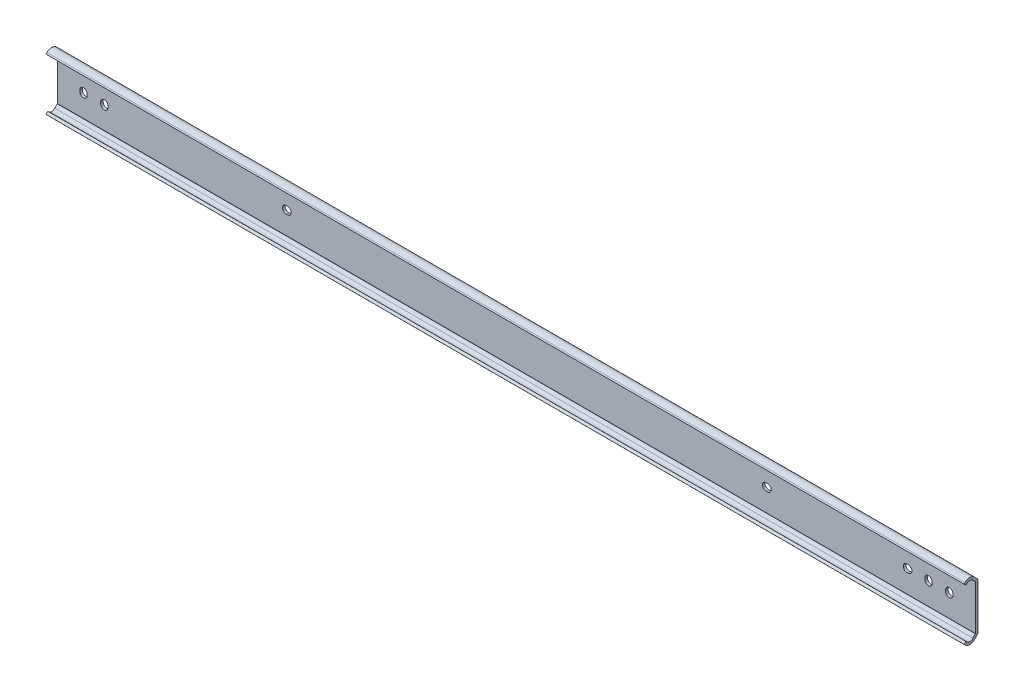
ISO-10303-21;
HEADER;
FILE_DESCRIPTION(('STEP AP214'),'2;1');
FILE_NAME('part.step','',(''),(''),'','','');
FILE_SCHEMA(('AUTOMOTIVE_DESIGN { 1 0 10303 214 1 1 1 1 }'));
ENDSEC;
DATA;
#1=APPLICATION_CONTEXT('core data for automotive mechanical design processes');
#2=APPLICATION_PROTOCOL_DEFINITION('international standard','automotive_design',2000,#1);
#3=PRODUCT_CONTEXT('',#1,'mechanical');
#4=PRODUCT('Part','Part','',(#3));
#5=PRODUCT_RELATED_PRODUCT_CATEGORY('part','',(#4));
#6=PRODUCT_DEFINITION_FORMATION('','',#4);
#7=PRODUCT_DEFINITION_CONTEXT('part definition',#1,'design');
#8=PRODUCT_DEFINITION('design','',#6,#7);
#9=PRODUCT_DEFINITION_SHAPE('','',#8);
#10=(LENGTH_UNIT() NAMED_UNIT(*) SI_UNIT(.MILLI.,.METRE.));
#11=(NAMED_UNIT(*) PLANE_ANGLE_UNIT() SI_UNIT($,.RADIAN.));
#12=(NAMED_UNIT(*) SI_UNIT($,.STERADIAN.) SOLID_ANGLE_UNIT());
#13=UNCERTAINTY_MEASURE_WITH_UNIT(LENGTH_MEASURE(1.E-05),#10,'distance_accuracy_value','');
#14=(GEOMETRIC_REPRESENTATION_CONTEXT(3) GLOBAL_UNCERTAINTY_ASSIGNED_CONTEXT((#13)) GLOBAL_UNIT_ASSIGNED_CONTEXT((#10,
#11,#12)) REPRESENTATION_CONTEXT('',''));
#15=CARTESIAN_POINT('',(0.,0.,0.));
#16=DIRECTION('',(0.,0.,1.));
#17=DIRECTION('',(1.,0.,0.));
#18=AXIS2_PLACEMENT_3D('',#15,#16,#17);
#19=CARTESIAN_POINT('',(-15.9,-13.5610180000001,0.));
#20=DIRECTION('',(0.,0.,-1.));
#21=DIRECTION('',(1.,0.,0.));
#22=AXIS2_PLACEMENT_3D('',#19,#20,#21);
#23=PLANE('',#22);
#24=DIRECTION('',(1.,0.,0.));
#25=VECTOR('',#24,1.);
#26=CARTESIAN_POINT('',(-15.9,13.561018,0.));
#27=LINE('',#26,#25);
#28=CARTESIAN_POINT('',(-15.9,13.561018,0.));
#29=VERTEX_POINT('',#28);
#30=CARTESIAN_POINT('',(542.9,13.561018,0.));
#31=VERTEX_POINT('',#30);
#32=EDGE_CURVE('E668',#29,#31,#27,.T.);
#33=ORIENTED_EDGE('',*,*,#32,.T.);
#34=DIRECTION('',(0.,1.,0.));
#35=VECTOR('',#34,1.);
#36=CARTESIAN_POINT('',(542.9,-13.5610180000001,0.));
#37=LINE('',#36,#35);
#38=CARTESIAN_POINT('',(542.9,-13.5610180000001,0.));
#39=VERTEX_POINT('',#38);
#40=EDGE_CURVE('E602',#39,#31,#37,.T.);
#41=ORIENTED_EDGE('',*,*,#40,.F.);
#42=DIRECTION('',(1.,0.,0.));
#43=VECTOR('',#42,1.);
#44=CARTESIAN_POINT('',(-15.9,-13.5610180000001,0.));
#45=LINE('',#44,#43);
#46=CARTESIAN_POINT('',(-15.9,-13.5610180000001,0.));
#47=VERTEX_POINT('',#46);
#48=EDGE_CURVE('E671',#47,#39,#45,.T.);
#49=ORIENTED_EDGE('',*,*,#48,.F.);
#50=DIRECTION('',(0.,1.,0.));
#51=VECTOR('',#50,1.);
#52=CARTESIAN_POINT('',(-15.9,-13.5610180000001,0.));
#53=LINE('',#52,#51);
#54=EDGE_CURVE('E659',#47,#29,#53,.T.);
#55=ORIENTED_EDGE('',*,*,#54,.T.);
#56=EDGE_LOOP('',(#33,#41,#49,#55));
#57=FACE_BOUND('',#56,.T.);
#58=CARTESIAN_POINT('',(416.3,0.,0.));
#59=DIRECTION('',(0.,0.,-1.));
#60=DIRECTION('',(1.,0.,0.));
#61=AXIS2_PLACEMENT_3D('',#58,#59,#60);
#62=CIRCLE('',#61,2.25);
#63=CARTESIAN_POINT('',(416.3,-2.25,0.));
#64=VERTEX_POINT('',#63);
#65=CARTESIAN_POINT('',(416.3,2.25,0.));
#66=VERTEX_POINT('',#65);
#67=EDGE_CURVE('E341',#64,#66,#62,.F.);
#68=ORIENTED_EDGE('',*,*,#67,.T.);
#69=DIRECTION('',(-1.,0.,0.));
#70=VECTOR('',#69,1.);
#71=CARTESIAN_POINT('',(416.3,2.25,0.));
#72=LINE('',#71,#70);
#73=CARTESIAN_POINT('',(415.5,2.25,0.));
#74=VERTEX_POINT('',#73);
#75=EDGE_CURVE('E353',#66,#74,#72,.T.);
#76=ORIENTED_EDGE('',*,*,#75,.T.);
#77=CARTESIAN_POINT('',(415.5,0.,0.));
#78=DIRECTION('',(0.,0.,-1.));
#79=DIRECTION('',(1.,0.,0.));
#80=AXIS2_PLACEMENT_3D('',#77,#78,#79);
#81=CIRCLE('',#80,2.25);
#82=CARTESIAN_POINT('',(415.5,-2.25,0.));
#83=VERTEX_POINT('',#82);
#84=EDGE_CURVE('E342',#74,#83,#81,.F.);
#85=ORIENTED_EDGE('',*,*,#84,.T.);
#86=DIRECTION('',(1.,0.,0.));
#87=VECTOR('',#86,1.);
#88=CARTESIAN_POINT('',(415.5,-2.25,0.));
#89=LINE('',#88,#87);
#90=EDGE_CURVE('E362',#83,#64,#89,.T.);
#91=ORIENTED_EDGE('',*,*,#90,.T.);
#92=EDGE_LOOP('',(#68,#76,#85,#91));
#93=FACE_BOUND('',#92,.T.);
#94=CARTESIAN_POINT('',(514.3,0.400000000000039,0.));
#95=DIRECTION('',(0.,0.,1.));
#96=DIRECTION('',(1.,0.,0.));
#97=AXIS2_PLACEMENT_3D('',#94,#95,#96);
#98=CIRCLE('',#97,2.24999999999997);
#99=CARTESIAN_POINT('',(516.55,0.400000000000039,0.));
#100=VERTEX_POINT('',#99);
#101=CARTESIAN_POINT('',(512.05,0.400000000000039,0.));
#102=VERTEX_POINT('',#101);
#103=EDGE_CURVE('E532',#100,#102,#98,.T.);
#104=ORIENTED_EDGE('',*,*,#103,.T.);
#105=DIRECTION('',(0.,-1.,0.));
#106=VECTOR('',#105,1.);
#107=CARTESIAN_POINT('',(512.05,0.400000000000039,0.));
#108=LINE('',#107,#106);
#109=CARTESIAN_POINT('',(512.05,-0.400000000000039,0.));
#110=VERTEX_POINT('',#109);
#111=EDGE_CURVE('E535',#102,#110,#108,.T.);
#112=ORIENTED_EDGE('',*,*,#111,.T.);
#113=CARTESIAN_POINT('',(514.3,-0.400000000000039,0.));
#114=DIRECTION('',(0.,0.,1.));
#115=DIRECTION('',(1.,0.,0.));
#116=AXIS2_PLACEMENT_3D('',#113,#114,#115);
#117=CIRCLE('',#116,2.24999999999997);
#118=CARTESIAN_POINT('',(516.55,-0.400000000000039,0.));
#119=VERTEX_POINT('',#118);
#120=EDGE_CURVE('E538',#110,#119,#117,.T.);
#121=ORIENTED_EDGE('',*,*,#120,.T.);
#122=DIRECTION('',(0.,1.,0.));
#123=VECTOR('',#122,1.);
#124=CARTESIAN_POINT('',(516.55,0.400000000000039,0.));
#125=LINE('',#124,#123);
#126=EDGE_CURVE('E541',#119,#100,#125,.T.);
#127=ORIENTED_EDGE('',*,*,#126,.T.);
#128=EDGE_LOOP('',(#104,#112,#121,#127));
#129=FACE_BOUND('',#128,.T.);
#130=CARTESIAN_POINT('',(527.,0.400000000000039,0.));
#131=DIRECTION('',(0.,0.,1.));
#132=DIRECTION('',(1.,0.,0.));
#133=AXIS2_PLACEMENT_3D('',#130,#131,#132);
#134=CIRCLE('',#133,2.24999999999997);
#135=CARTESIAN_POINT('',(529.25,0.400000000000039,0.));
#136=VERTEX_POINT('',#135);
#137=CARTESIAN_POINT('',(524.75,0.400000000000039,0.));
#138=VERTEX_POINT('',#137);
#139=EDGE_CURVE('E500',#136,#138,#134,.T.);
#140=ORIENTED_EDGE('',*,*,#139,.T.);
#141=DIRECTION('',(0.,-1.,0.));
#142=VECTOR('',#141,1.);
#143=CARTESIAN_POINT('',(524.75,0.400000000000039,0.));
#144=LINE('',#143,#142);
#145=CARTESIAN_POINT('',(524.75,-0.400000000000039,0.));
#146=VERTEX_POINT('',#145);
#147=EDGE_CURVE('E503',#138,#146,#144,.T.);
#148=ORIENTED_EDGE('',*,*,#147,.T.);
#149=CARTESIAN_POINT('',(527.,-0.400000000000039,0.));
#150=DIRECTION('',(0.,0.,1.));
#151=DIRECTION('',(1.,0.,0.));
#152=AXIS2_PLACEMENT_3D('',#149,#150,#151);
#153=CIRCLE('',#152,2.24999999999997);
#154=CARTESIAN_POINT('',(529.25,-0.400000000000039,0.));
#155=VERTEX_POINT('',#154);
#156=EDGE_CURVE('E506',#146,#155,#153,.T.);
#157=ORIENTED_EDGE('',*,*,#156,.T.);
#158=DIRECTION('',(0.,1.,0.));
#159=VECTOR('',#158,1.);
#160=CARTESIAN_POINT('',(529.25,0.400000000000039,0.));
#161=LINE('',#160,#159);
#162=EDGE_CURVE('E509',#155,#136,#161,.T.);
#163=ORIENTED_EDGE('',*,*,#162,.T.);
#164=EDGE_LOOP('',(#140,#148,#157,#163));
#165=FACE_BOUND('',#164,.T.);
#166=CARTESIAN_POINT('',(12.7,0.400000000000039,0.));
#167=DIRECTION('',(0.,0.,1.));
#168=DIRECTION('',(1.,0.,0.));
#169=AXIS2_PLACEMENT_3D('',#166,#167,#168);
#170=CIRCLE('',#169,2.24999999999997);
#171=CARTESIAN_POINT('',(14.95,0.400000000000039,0.));
#172=VERTEX_POINT('',#171);
#173=CARTESIAN_POINT('',(10.45,0.400000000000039,0.));
#174=VERTEX_POINT('',#173);
#175=EDGE_CURVE('E468',#172,#174,#170,.T.);
#176=ORIENTED_EDGE('',*,*,#175,.T.);
#177=DIRECTION('',(0.,-1.,0.));
#178=VECTOR('',#177,1.);
#179=CARTESIAN_POINT('',(10.45,0.400000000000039,0.));
#180=LINE('',#179,#178);
#181=CARTESIAN_POINT('',(10.45,-0.400000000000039,0.));
#182=VERTEX_POINT('',#181);
#183=EDGE_CURVE('E471',#174,#182,#180,.T.);
#184=ORIENTED_EDGE('',*,*,#183,.T.);
#185=CARTESIAN_POINT('',(12.7,-0.400000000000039,0.));
#186=DIRECTION('',(0.,0.,1.));
#187=DIRECTION('',(1.,0.,0.));
#188=AXIS2_PLACEMENT_3D('',#185,#186,#187);
#189=CIRCLE('',#188,2.24999999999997);
#190=CARTESIAN_POINT('',(14.95,-0.400000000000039,0.));
#191=VERTEX_POINT('',#190);
#192=EDGE_CURVE('E474',#182,#191,#189,.T.);
#193=ORIENTED_EDGE('',*,*,#192,.T.);
#194=DIRECTION('',(0.,1.,0.));
#195=VECTOR('',#194,1.);
#196=CARTESIAN_POINT('',(14.95,0.400000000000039,0.));
#197=LINE('',#196,#195);
#198=EDGE_CURVE('E477',#191,#172,#197,.T.);
#199=ORIENTED_EDGE('',*,*,#198,.T.);
#200=EDGE_LOOP('',(#176,#184,#193,#199));
#201=FACE_BOUND('',#200,.T.);
#202=CARTESIAN_POINT('',(502.,0.,0.));
#203=DIRECTION('',(0.,0.,1.));
#204=DIRECTION('',(1.,0.,0.));
#205=AXIS2_PLACEMENT_3D('',#202,#203,#204);
#206=CIRCLE('',#205,2.25);
#207=CARTESIAN_POINT('',(502.,-2.25,0.));
#208=VERTEX_POINT('',#207);
#209=CARTESIAN_POINT('',(502.,2.25,0.));
#210=VERTEX_POINT('',#209);
#211=EDGE_CURVE('E436',#208,#210,#206,.T.);
#212=ORIENTED_EDGE('',*,*,#211,.T.);
#213=DIRECTION('',(-1.,0.,0.));
#214=VECTOR('',#213,1.);
#215=CARTESIAN_POINT('',(502.,2.25,0.));
#216=LINE('',#215,#214);
#217=CARTESIAN_POINT('',(501.2,2.25,0.));
#218=VERTEX_POINT('',#217);
#219=EDGE_CURVE('E439',#210,#218,#216,.T.);
#220=ORIENTED_EDGE('',*,*,#219,.T.);
#221=CARTESIAN_POINT('',(501.2,0.,0.));
#222=DIRECTION('',(0.,0.,1.));
#223=DIRECTION('',(1.,0.,0.));
#224=AXIS2_PLACEMENT_3D('',#221,#222,#223);
#225=CIRCLE('',#224,2.25);
#226=CARTESIAN_POINT('',(501.2,-2.25,0.));
#227=VERTEX_POINT('',#226);
#228=EDGE_CURVE('E442',#218,#227,#225,.T.);
#229=ORIENTED_EDGE('',*,*,#228,.T.);
#230=DIRECTION('',(1.,0.,0.));
#231=VECTOR('',#230,1.);
#232=CARTESIAN_POINT('',(502.,-2.25,0.));
#233=LINE('',#232,#231);
#234=EDGE_CURVE('E445',#227,#208,#233,.T.);
#235=ORIENTED_EDGE('',*,*,#234,.T.);
#236=EDGE_LOOP('',(#212,#220,#229,#235));
#237=FACE_BOUND('',#236,.T.);
#238=CARTESIAN_POINT('',(0.,0.400000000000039,0.));
#239=DIRECTION('',(0.,0.,1.));
#240=DIRECTION('',(1.,0.,0.));
#241=AXIS2_PLACEMENT_3D('',#238,#239,#240);
#242=CIRCLE('',#241,2.24999999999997);
#243=CARTESIAN_POINT('',(2.25000000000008,0.400000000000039,0.));
#244=VERTEX_POINT('',#243);
#245=CARTESIAN_POINT('',(-2.24999999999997,0.400000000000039,0.));
#246=VERTEX_POINT('',#245);
#247=EDGE_CURVE('E404',#244,#246,#242,.T.);
#248=ORIENTED_EDGE('',*,*,#247,.T.);
#249=DIRECTION('',(0.,-1.,0.));
#250=VECTOR('',#249,1.);
#251=CARTESIAN_POINT('',(-2.24999999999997,0.400000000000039,0.));
#252=LINE('',#251,#250);
#253=CARTESIAN_POINT('',(-2.24999999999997,-0.400000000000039,0.));
#254=VERTEX_POINT('',#253);
#255=EDGE_CURVE('E407',#246,#254,#252,.T.);
#256=ORIENTED_EDGE('',*,*,#255,.T.);
#257=CARTESIAN_POINT('',(0.,-0.400000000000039,0.));
#258=DIRECTION('',(0.,0.,1.));
#259=DIRECTION('',(1.,0.,0.));
#260=AXIS2_PLACEMENT_3D('',#257,#258,#259);
#261=CIRCLE('',#260,2.24999999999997);
#262=CARTESIAN_POINT('',(2.25000000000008,-0.400000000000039,0.));
#263=VERTEX_POINT('',#262);
#264=EDGE_CURVE('E410',#254,#263,#261,.T.);
#265=ORIENTED_EDGE('',*,*,#264,.T.);
#266=DIRECTION('',(0.,1.,0.));
#267=VECTOR('',#266,1.);
#268=CARTESIAN_POINT('',(2.25000000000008,0.400000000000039,0.));
#269=LINE('',#268,#267);
#270=EDGE_CURVE('E413',#263,#244,#269,.T.);
#271=ORIENTED_EDGE('',*,*,#270,.T.);
#272=EDGE_LOOP('',(#248,#256,#265,#271));
#273=FACE_BOUND('',#272,.T.);
#274=CARTESIAN_POINT('',(124.2,0.,0.));
#275=DIRECTION('',(0.,0.,1.));
#276=DIRECTION('',(1.,0.,0.));
#277=AXIS2_PLACEMENT_3D('',#274,#275,#276);
#278=CIRCLE('',#277,2.25);
#279=CARTESIAN_POINT('',(124.2,-2.24999999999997,0.));
#280=VERTEX_POINT('',#279);
#281=CARTESIAN_POINT('',(124.2,2.25000000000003,0.));
#282=VERTEX_POINT('',#281);
#283=EDGE_CURVE('E375',#280,#282,#278,.T.);
#284=ORIENTED_EDGE('',*,*,#283,.T.);
#285=DIRECTION('',(-1.,0.,0.));
#286=VECTOR('',#285,1.);
#287=CARTESIAN_POINT('',(124.2,2.25000000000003,0.));
#288=LINE('',#287,#286);
#289=CARTESIAN_POINT('',(123.4,2.25000000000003,0.));
#290=VERTEX_POINT('',#289);
#291=EDGE_CURVE('E378',#282,#290,#288,.T.);
#292=ORIENTED_EDGE('',*,*,#291,.T.);
#293=CARTESIAN_POINT('',(123.4,0.,0.));
#294=DIRECTION('',(0.,0.,1.));
#295=DIRECTION('',(1.,0.,0.));
#296=AXIS2_PLACEMENT_3D('',#293,#294,#295);
#297=CIRCLE('',#296,2.25);
#298=CARTESIAN_POINT('',(123.4,-2.24999999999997,0.));
#299=VERTEX_POINT('',#298);
#300=EDGE_CURVE('E31',#290,#299,#297,.T.);
#301=ORIENTED_EDGE('',*,*,#300,.T.);
#302=DIRECTION('',(1.,0.,0.));
#303=VECTOR('',#302,1.);
#304=CARTESIAN_POINT('',(124.2,-2.24999999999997,0.));
#305=LINE('',#304,#303);
#306=EDGE_CURVE('E382',#299,#280,#305,.T.);
#307=ORIENTED_EDGE('',*,*,#306,.T.);
#308=EDGE_LOOP('',(#284,#292,#301,#307));
#309=FACE_BOUND('',#308,.T.);
#310=ADVANCED_FACE('F14',(#57,#93,#129,#165,#201,#237,#273,#309),#23,.T.);
#311=CARTESIAN_POINT('',(-15.9,13.561018,1.54999999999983));
#312=DIRECTION('',(0.,0.,1.));
#313=DIRECTION('',(-1.,0.,0.));
#314=AXIS2_PLACEMENT_3D('',#311,#312,#313);
#315=PLANE('',#314);
#316=DIRECTION('',(1.,0.,0.));
#317=VECTOR('',#316,1.);
#318=CARTESIAN_POINT('',(-15.9,-13.5610180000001,1.54999999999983));
#319=LINE('',#318,#317);
#320=CARTESIAN_POINT('',(-15.9,-13.5610180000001,1.54999999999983));
#321=VERTEX_POINT('',#320);
#322=CARTESIAN_POINT('',(542.9,-13.5610180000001,1.54999999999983));
#323=VERTEX_POINT('',#322);
#324=EDGE_CURVE('E690',#321,#323,#319,.T.);
#325=ORIENTED_EDGE('',*,*,#324,.T.);
#326=DIRECTION('',(0.,-1.,0.));
#327=VECTOR('',#326,1.);
#328=CARTESIAN_POINT('',(542.9,13.561018,1.54999999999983));
#329=LINE('',#328,#327);
#330=CARTESIAN_POINT('',(542.9,13.561018,1.54999999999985));
#331=VERTEX_POINT('',#330);
#332=EDGE_CURVE('E574',#331,#323,#329,.T.);
#333=ORIENTED_EDGE('',*,*,#332,.F.);
#334=DIRECTION('',(1.,0.,0.));
#335=VECTOR('',#334,1.);
#336=CARTESIAN_POINT('',(-15.9,13.561018,1.54999999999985));
#337=LINE('',#336,#335);
#338=CARTESIAN_POINT('',(-15.9,13.561018,1.54999999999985));
#339=VERTEX_POINT('',#338);
#340=EDGE_CURVE('E693',#339,#331,#337,.T.);
#341=ORIENTED_EDGE('',*,*,#340,.F.);
#342=DIRECTION('',(0.,-1.,0.));
#343=VECTOR('',#342,1.);
#344=CARTESIAN_POINT('',(-15.9,13.561018,1.54999999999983));
#345=LINE('',#344,#343);
#346=EDGE_CURVE('E630',#339,#321,#345,.T.);
#347=ORIENTED_EDGE('',*,*,#346,.T.);
#348=EDGE_LOOP('',(#325,#333,#341,#347));
#349=FACE_BOUND('',#348,.T.);
#350=DIRECTION('',(-1.,0.,0.));
#351=VECTOR('',#350,1.);
#352=CARTESIAN_POINT('',(416.3,2.25,1.54999999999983));
#353=LINE('',#352,#351);
#354=CARTESIAN_POINT('',(416.3,2.25,1.54999999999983));
#355=VERTEX_POINT('',#354);
#356=CARTESIAN_POINT('',(415.5,2.25,1.54999999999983));
#357=VERTEX_POINT('',#356);
#358=EDGE_CURVE('E332',#355,#357,#353,.T.);
#359=ORIENTED_EDGE('',*,*,#358,.F.);
#360=CARTESIAN_POINT('',(416.3,0.,1.54999999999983));
#361=DIRECTION('',(0.,0.,1.));
#362=DIRECTION('',(-1.,0.,0.));
#363=AXIS2_PLACEMENT_3D('',#360,#361,#362);
#364=CIRCLE('',#363,2.25);
#365=CARTESIAN_POINT('',(416.3,-2.25,1.54999999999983));
#366=VERTEX_POINT('',#365);
#367=EDGE_CURVE('E339',#366,#355,#364,.T.);
#368=ORIENTED_EDGE('',*,*,#367,.F.);
#369=DIRECTION('',(1.,0.,0.));
#370=VECTOR('',#369,1.);
#371=CARTESIAN_POINT('',(415.5,-2.25,1.54999999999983));
#372=LINE('',#371,#370);
#373=CARTESIAN_POINT('',(415.5,-2.25,1.54999999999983));
#374=VERTEX_POINT('',#373);
#375=EDGE_CURVE('E321',#374,#366,#372,.T.);
#376=ORIENTED_EDGE('',*,*,#375,.F.);
#377=CARTESIAN_POINT('',(415.5,0.,1.54999999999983));
#378=DIRECTION('',(0.,0.,1.));
#379=DIRECTION('',(-1.,0.,0.));
#380=AXIS2_PLACEMENT_3D('',#377,#378,#379);
#381=CIRCLE('',#380,2.25);
#382=EDGE_CURVE('E333',#357,#374,#381,.T.);
#383=ORIENTED_EDGE('',*,*,#382,.F.);
#384=EDGE_LOOP('',(#359,#368,#376,#383));
#385=FACE_BOUND('',#384,.T.);
#386=CARTESIAN_POINT('',(514.3,0.400000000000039,1.54999999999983));
#387=DIRECTION('',(0.,0.,1.));
#388=DIRECTION('',(1.,0.,0.));
#389=AXIS2_PLACEMENT_3D('',#386,#387,#388);
#390=CIRCLE('',#389,2.24999999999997);
#391=CARTESIAN_POINT('',(516.55,0.400000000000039,1.54999999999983));
#392=VERTEX_POINT('',#391);
#393=CARTESIAN_POINT('',(512.05,0.400000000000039,1.54999999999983));
#394=VERTEX_POINT('',#393);
#395=EDGE_CURVE('E515',#392,#394,#390,.T.);
#396=ORIENTED_EDGE('',*,*,#395,.F.);
#397=DIRECTION('',(0.,1.,0.));
#398=VECTOR('',#397,1.);
#399=CARTESIAN_POINT('',(516.55,0.400000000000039,1.54999999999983));
#400=LINE('',#399,#398);
#401=CARTESIAN_POINT('',(516.55,-0.400000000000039,1.54999999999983));
#402=VERTEX_POINT('',#401);
#403=EDGE_CURVE('E529',#402,#392,#400,.T.);
#404=ORIENTED_EDGE('',*,*,#403,.F.);
#405=CARTESIAN_POINT('',(514.3,-0.400000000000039,1.54999999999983));
#406=DIRECTION('',(0.,0.,1.));
#407=DIRECTION('',(1.,0.,0.));
#408=AXIS2_PLACEMENT_3D('',#405,#406,#407);
#409=CIRCLE('',#408,2.24999999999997);
#410=CARTESIAN_POINT('',(512.05,-0.40000000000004,1.54999999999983));
#411=VERTEX_POINT('',#410);
#412=EDGE_CURVE('E526',#411,#402,#409,.T.);
#413=ORIENTED_EDGE('',*,*,#412,.F.);
#414=DIRECTION('',(0.,-1.,0.));
#415=VECTOR('',#414,1.);
#416=CARTESIAN_POINT('',(512.05,0.400000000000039,1.54999999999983));
#417=LINE('',#416,#415);
#418=EDGE_CURVE('E523',#394,#411,#417,.T.);
#419=ORIENTED_EDGE('',*,*,#418,.F.);
#420=EDGE_LOOP('',(#396,#404,#413,#419));
#421=FACE_BOUND('',#420,.T.);
#422=CARTESIAN_POINT('',(527.,0.400000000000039,1.54999999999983));
#423=DIRECTION('',(0.,0.,1.));
#424=DIRECTION('',(1.,0.,0.));
#425=AXIS2_PLACEMENT_3D('',#422,#423,#424);
#426=CIRCLE('',#425,2.24999999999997);
#427=CARTESIAN_POINT('',(529.25,0.400000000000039,1.54999999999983));
#428=VERTEX_POINT('',#427);
#429=CARTESIAN_POINT('',(524.75,0.400000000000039,1.54999999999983));
#430=VERTEX_POINT('',#429);
#431=EDGE_CURVE('E483',#428,#430,#426,.T.);
#432=ORIENTED_EDGE('',*,*,#431,.F.);
#433=DIRECTION('',(0.,1.,0.));
#434=VECTOR('',#433,1.);
#435=CARTESIAN_POINT('',(529.25,0.400000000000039,1.54999999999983));
#436=LINE('',#435,#434);
#437=CARTESIAN_POINT('',(529.25,-0.400000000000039,1.54999999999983));
#438=VERTEX_POINT('',#437);
#439=EDGE_CURVE('E497',#438,#428,#436,.T.);
#440=ORIENTED_EDGE('',*,*,#439,.F.);
#441=CARTESIAN_POINT('',(527.,-0.400000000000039,1.54999999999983));
#442=DIRECTION('',(0.,0.,1.));
#443=DIRECTION('',(1.,0.,0.));
#444=AXIS2_PLACEMENT_3D('',#441,#442,#443);
#445=CIRCLE('',#444,2.24999999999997);
#446=CARTESIAN_POINT('',(524.75,-0.40000000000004,1.54999999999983));
#447=VERTEX_POINT('',#446);
#448=EDGE_CURVE('E494',#447,#438,#445,.T.);
#449=ORIENTED_EDGE('',*,*,#448,.F.);
#450=DIRECTION('',(0.,-1.,0.));
#451=VECTOR('',#450,1.);
#452=CARTESIAN_POINT('',(524.75,0.400000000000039,1.54999999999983));
#453=LINE('',#452,#451);
#454=EDGE_CURVE('E491',#430,#447,#453,.T.);
#455=ORIENTED_EDGE('',*,*,#454,.F.);
#456=EDGE_LOOP('',(#432,#440,#449,#455));
#457=FACE_BOUND('',#456,.T.);
#458=CARTESIAN_POINT('',(12.7,0.400000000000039,1.54999999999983));
#459=DIRECTION('',(0.,0.,1.));
#460=DIRECTION('',(1.,0.,0.));
#461=AXIS2_PLACEMENT_3D('',#458,#459,#460);
#462=CIRCLE('',#461,2.24999999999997);
#463=CARTESIAN_POINT('',(14.95,0.400000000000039,1.54999999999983));
#464=VERTEX_POINT('',#463);
#465=CARTESIAN_POINT('',(10.45,0.400000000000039,1.54999999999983));
#466=VERTEX_POINT('',#465);
#467=EDGE_CURVE('E451',#464,#466,#462,.T.);
#468=ORIENTED_EDGE('',*,*,#467,.F.);
#469=DIRECTION('',(0.,1.,0.));
#470=VECTOR('',#469,1.);
#471=CARTESIAN_POINT('',(14.95,0.400000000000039,1.54999999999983));
#472=LINE('',#471,#470);
#473=CARTESIAN_POINT('',(14.95,-0.400000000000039,1.54999999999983));
#474=VERTEX_POINT('',#473);
#475=EDGE_CURVE('E465',#474,#464,#472,.T.);
#476=ORIENTED_EDGE('',*,*,#475,.F.);
#477=CARTESIAN_POINT('',(12.7,-0.400000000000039,1.54999999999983));
#478=DIRECTION('',(0.,0.,1.));
#479=DIRECTION('',(1.,0.,0.));
#480=AXIS2_PLACEMENT_3D('',#477,#478,#479);
#481=CIRCLE('',#480,2.24999999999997);
#482=CARTESIAN_POINT('',(10.45,-0.40000000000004,1.54999999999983));
#483=VERTEX_POINT('',#482);
#484=EDGE_CURVE('E462',#483,#474,#481,.T.);
#485=ORIENTED_EDGE('',*,*,#484,.F.);
#486=DIRECTION('',(0.,-1.,0.));
#487=VECTOR('',#486,1.);
#488=CARTESIAN_POINT('',(10.45,0.400000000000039,1.54999999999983));
#489=LINE('',#488,#487);
#490=EDGE_CURVE('E459',#466,#483,#489,.T.);
#491=ORIENTED_EDGE('',*,*,#490,.F.);
#492=EDGE_LOOP('',(#468,#476,#485,#491));
#493=FACE_BOUND('',#492,.T.);
#494=CARTESIAN_POINT('',(502.,0.,1.54999999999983));
#495=DIRECTION('',(0.,0.,1.));
#496=DIRECTION('',(1.,0.,0.));
#497=AXIS2_PLACEMENT_3D('',#494,#495,#496);
#498=CIRCLE('',#497,2.25);
#499=CARTESIAN_POINT('',(502.,-2.25,1.54999999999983));
#500=VERTEX_POINT('',#499);
#501=CARTESIAN_POINT('',(502.,2.25,1.54999999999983));
#502=VERTEX_POINT('',#501);
#503=EDGE_CURVE('E419',#500,#502,#498,.T.);
#504=ORIENTED_EDGE('',*,*,#503,.F.);
#505=DIRECTION('',(1.,0.,0.));
#506=VECTOR('',#505,1.);
#507=CARTESIAN_POINT('',(502.,-2.25,1.54999999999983));
#508=LINE('',#507,#506);
#509=CARTESIAN_POINT('',(501.2,-2.25,1.54999999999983));
#510=VERTEX_POINT('',#509);
#511=EDGE_CURVE('E433',#510,#500,#508,.T.);
#512=ORIENTED_EDGE('',*,*,#511,.F.);
#513=CARTESIAN_POINT('',(501.2,0.,1.54999999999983));
#514=DIRECTION('',(0.,0.,1.));
#515=DIRECTION('',(1.,0.,0.));
#516=AXIS2_PLACEMENT_3D('',#513,#514,#515);
#517=CIRCLE('',#516,2.25);
#518=CARTESIAN_POINT('',(501.2,2.25,1.54999999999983));
#519=VERTEX_POINT('',#518);
#520=EDGE_CURVE('E430',#519,#510,#517,.T.);
#521=ORIENTED_EDGE('',*,*,#520,.F.);
#522=DIRECTION('',(-1.,0.,0.));
#523=VECTOR('',#522,1.);
#524=CARTESIAN_POINT('',(502.,2.25,1.54999999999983));
#525=LINE('',#524,#523);
#526=EDGE_CURVE('E427',#502,#519,#525,.T.);
#527=ORIENTED_EDGE('',*,*,#526,.F.);
#528=EDGE_LOOP('',(#504,#512,#521,#527));
#529=FACE_BOUND('',#528,.T.);
#530=CARTESIAN_POINT('',(0.,0.400000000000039,1.54999999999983));
#531=DIRECTION('',(0.,0.,1.));
#532=DIRECTION('',(1.,0.,0.));
#533=AXIS2_PLACEMENT_3D('',#530,#531,#532);
#534=CIRCLE('',#533,2.24999999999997);
#535=CARTESIAN_POINT('',(2.25000000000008,0.400000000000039,1.54999999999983));
#536=VERTEX_POINT('',#535);
#537=CARTESIAN_POINT('',(-2.24999999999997,0.400000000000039,1.54999999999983));
#538=VERTEX_POINT('',#537);
#539=EDGE_CURVE('E388',#536,#538,#534,.T.);
#540=ORIENTED_EDGE('',*,*,#539,.F.);
#541=DIRECTION('',(0.,1.,0.));
#542=VECTOR('',#541,1.);
#543=CARTESIAN_POINT('',(2.25000000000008,0.400000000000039,1.54999999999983));
#544=LINE('',#543,#542);
#545=CARTESIAN_POINT('',(2.25000000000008,-0.400000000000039,1.54999999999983));
#546=VERTEX_POINT('',#545);
#547=EDGE_CURVE('E401',#546,#536,#544,.T.);
#548=ORIENTED_EDGE('',*,*,#547,.F.);
#549=CARTESIAN_POINT('',(0.,-0.400000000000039,1.54999999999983));
#550=DIRECTION('',(0.,0.,1.));
#551=DIRECTION('',(1.,0.,0.));
#552=AXIS2_PLACEMENT_3D('',#549,#550,#551);
#553=CIRCLE('',#552,2.24999999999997);
#554=CARTESIAN_POINT('',(-2.24999999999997,-0.40000000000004,1.54999999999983));
#555=VERTEX_POINT('',#554);
#556=EDGE_CURVE('E398',#555,#546,#553,.T.);
#557=ORIENTED_EDGE('',*,*,#556,.F.);
#558=DIRECTION('',(0.,-1.,0.));
#559=VECTOR('',#558,1.);
#560=CARTESIAN_POINT('',(-2.24999999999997,0.400000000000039,1.54999999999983));
#561=LINE('',#560,#559);
#562=EDGE_CURVE('E395',#538,#555,#561,.T.);
#563=ORIENTED_EDGE('',*,*,#562,.F.);
#564=EDGE_LOOP('',(#540,#548,#557,#563));
#565=FACE_BOUND('',#564,.T.);
#566=CARTESIAN_POINT('',(124.2,0.,1.54999999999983));
#567=DIRECTION('',(0.,0.,1.));
#568=DIRECTION('',(1.,0.,0.));
#569=AXIS2_PLACEMENT_3D('',#566,#567,#568);
#570=CIRCLE('',#569,2.25);
#571=CARTESIAN_POINT('',(124.2,-2.24999999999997,1.54999999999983));
#572=VERTEX_POINT('',#571);
#573=CARTESIAN_POINT('',(124.2,2.25000000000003,1.54999999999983));
#574=VERTEX_POINT('',#573);
#575=EDGE_CURVE('E39',#572,#574,#570,.T.);
#576=ORIENTED_EDGE('',*,*,#575,.F.);
#577=DIRECTION('',(1.,0.,0.));
#578=VECTOR('',#577,1.);
#579=CARTESIAN_POINT('',(124.2,-2.24999999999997,1.54999999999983));
#580=LINE('',#579,#578);
#581=CARTESIAN_POINT('',(123.4,-2.24999999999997,1.54999999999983));
#582=VERTEX_POINT('',#581);
#583=EDGE_CURVE('E372',#582,#572,#580,.T.);
#584=ORIENTED_EDGE('',*,*,#583,.F.);
#585=CARTESIAN_POINT('',(123.4,0.,1.54999999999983));
#586=DIRECTION('',(0.,0.,1.));
#587=DIRECTION('',(1.,0.,0.));
#588=AXIS2_PLACEMENT_3D('',#585,#586,#587);
#589=CIRCLE('',#588,2.25);
#590=CARTESIAN_POINT('',(123.4,2.25000000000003,1.54999999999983));
#591=VERTEX_POINT('',#590);
#592=EDGE_CURVE('E369',#591,#582,#589,.T.);
#593=ORIENTED_EDGE('',*,*,#592,.F.);
#594=DIRECTION('',(-1.,0.,0.));
#595=VECTOR('',#594,1.);
#596=CARTESIAN_POINT('',(124.2,2.25000000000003,1.54999999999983));
#597=LINE('',#596,#595);
#598=EDGE_CURVE('E366',#574,#591,#597,.T.);
#599=ORIENTED_EDGE('',*,*,#598,.F.);
#600=EDGE_LOOP('',(#576,#584,#593,#599));
#601=FACE_BOUND('',#600,.T.);
#602=ADVANCED_FACE('F345',(#349,#385,#421,#457,#493,#529,#565,#601),#315,.T.);
#603=CARTESIAN_POINT('',(542.9,13.575,5.00000000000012));
#604=DIRECTION('',(-1.,0.,0.));
#605=DIRECTION('',(0.,0.,-1.));
#606=AXIS2_PLACEMENT_3D('',#603,#604,#605);
#607=PLANE('',#606);
#608=ORIENTED_EDGE('',*,*,#40,.T.);
#609=CARTESIAN_POINT('',(542.9,13.5610179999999,1.80000000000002));
#610=DIRECTION('',(1.,0.,0.));
#611=DIRECTION('',(0.,0.,-1.));
#612=AXIS2_PLACEMENT_3D('',#609,#610,#611);
#613=CIRCLE('',#612,1.8);
#614=CARTESIAN_POINT('',(542.9,14.8073560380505,0.501292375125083));
#615=VERTEX_POINT('',#614);
#616=EDGE_CURVE('E604',#31,#615,#613,.T.);
#617=ORIENTED_EDGE('',*,*,#616,.T.);
#618=DIRECTION('',(0.,0.721504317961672,0.692409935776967));
#619=VECTOR('',#618,1.);
#620=CARTESIAN_POINT('',(542.9,14.8073560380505,0.501292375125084));
#621=LINE('',#620,#619);
#622=CARTESIAN_POINT('',(542.9,16.4741282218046,2.10085261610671));
#623=VERTEX_POINT('',#622);
#624=EDGE_CURVE('E607',#615,#623,#621,.T.);
#625=ORIENTED_EDGE('',*,*,#624,.T.);
#626=CARTESIAN_POINT('',(542.9,13.575,5.00000000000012));
#627=DIRECTION('',(1.,0.,0.));
#628=DIRECTION('',(0.,0.,-1.));
#629=AXIS2_PLACEMENT_3D('',#626,#627,#628);
#630=CIRCLE('',#629,4.1);
#631=CARTESIAN_POINT('',(542.9,16.4741282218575,7.89914738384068));
#632=VERTEX_POINT('',#631);
#633=EDGE_CURVE('E547',#623,#632,#630,.T.);
#634=ORIENTED_EDGE('',*,*,#633,.T.);
#635=DIRECTION('',(0.,-0.721504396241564,0.692409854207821));
#636=VECTOR('',#635,1.);
#637=CARTESIAN_POINT('',(542.9,15.8897090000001,8.45999999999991));
#638=LINE('',#637,#636);
#639=CARTESIAN_POINT('',(542.9,15.8897090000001,8.45999999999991));
#640=VERTEX_POINT('',#639);
#641=EDGE_CURVE('E556',#632,#640,#638,.T.);
#642=ORIENTED_EDGE('',*,*,#641,.T.);
#643=DIRECTION('',(0.,-0.707106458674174,-0.707107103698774));
#644=VECTOR('',#643,1.);
#645=CARTESIAN_POINT('',(542.9,14.793462,7.363752));
#646=LINE('',#645,#644);
#647=CARTESIAN_POINT('',(542.9,14.793462,7.363752));
#648=VERTEX_POINT('',#647);
#649=EDGE_CURVE('E559',#640,#648,#646,.T.);
#650=ORIENTED_EDGE('',*,*,#649,.T.);
#651=DIRECTION('',(0.,0.721503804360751,-0.692410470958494));
#652=VECTOR('',#651,1.);
#653=CARTESIAN_POINT('',(542.9,15.3880487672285,6.79314086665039));
#654=LINE('',#653,#652);
#655=CARTESIAN_POINT('',(542.9,15.3880487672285,6.79314086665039));
#656=VERTEX_POINT('',#655);
#657=EDGE_CURVE('E562',#648,#656,#654,.T.);
#658=ORIENTED_EDGE('',*,*,#657,.T.);
#659=CARTESIAN_POINT('',(542.9,13.575,5.00000000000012));
#660=DIRECTION('',(-1.,0.,0.));
#661=DIRECTION('',(0.,0.,1.));
#662=AXIS2_PLACEMENT_3D('',#659,#660,#661);
#663=CIRCLE('',#662,2.55);
#664=CARTESIAN_POINT('',(542.9,15.2920682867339,3.11474762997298));
#665=VERTEX_POINT('',#664);
#666=EDGE_CURVE('E565',#656,#665,#663,.T.);
#667=ORIENTED_EDGE('',*,*,#666,.T.);
#668=DIRECTION('',(0.,-0.721504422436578,-0.692409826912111));
#669=VECTOR('',#668,1.);
#670=CARTESIAN_POINT('',(542.9,13.7341205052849,1.61962394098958));
#671=LINE('',#670,#669);
#672=CARTESIAN_POINT('',(542.9,13.7341205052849,1.61962394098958));
#673=VERTEX_POINT('',#672);
#674=EDGE_CURVE('E568',#665,#673,#671,.T.);
#675=ORIENTED_EDGE('',*,*,#674,.T.);
#676=CARTESIAN_POINT('',(542.9,13.5610179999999,1.80000000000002));
#677=DIRECTION('',(-1.,0.,0.));
#678=DIRECTION('',(0.,0.,1.));
#679=AXIS2_PLACEMENT_3D('',#676,#677,#678);
#680=CIRCLE('',#679,0.250000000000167);
#681=EDGE_CURVE('E571',#673,#331,#680,.T.);
#682=ORIENTED_EDGE('',*,*,#681,.T.);
#683=ORIENTED_EDGE('',*,*,#332,.T.);
#684=CARTESIAN_POINT('',(542.9,-13.561018,1.80000000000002));
#685=DIRECTION('',(-1.,0.,0.));
#686=DIRECTION('',(0.,0.,-1.));
#687=AXIS2_PLACEMENT_3D('',#684,#685,#686);
#688=CIRCLE('',#687,0.250000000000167);
#689=CARTESIAN_POINT('',(542.9,-13.734120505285,1.61962394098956));
#690=VERTEX_POINT('',#689);
#691=EDGE_CURVE('E576',#323,#690,#688,.T.);
#692=ORIENTED_EDGE('',*,*,#691,.T.);
#693=DIRECTION('',(0.,-0.721504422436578,0.692409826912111));
#694=VECTOR('',#693,1.);
#695=CARTESIAN_POINT('',(542.9,-13.734120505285,1.61962394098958));
#696=LINE('',#695,#694);
#697=CARTESIAN_POINT('',(542.9,-15.292068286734,3.11474762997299));
#698=VERTEX_POINT('',#697);
#699=EDGE_CURVE('E579',#690,#698,#696,.T.);
#700=ORIENTED_EDGE('',*,*,#699,.T.);
#701=CARTESIAN_POINT('',(542.9,-13.5750000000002,5.00000000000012));
#702=DIRECTION('',(-1.,0.,0.));
#703=DIRECTION('',(0.,0.,-1.));
#704=AXIS2_PLACEMENT_3D('',#701,#702,#703);
#705=CIRCLE('',#704,2.55);
#706=CARTESIAN_POINT('',(542.9,-15.3880487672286,6.79314086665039));
#707=VERTEX_POINT('',#706);
#708=EDGE_CURVE('E582',#698,#707,#705,.T.);
#709=ORIENTED_EDGE('',*,*,#708,.T.);
#710=DIRECTION('',(0.,0.721503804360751,0.692410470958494));
#711=VECTOR('',#710,1.);
#712=CARTESIAN_POINT('',(542.9,-15.3880487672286,6.79314086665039));
#713=LINE('',#712,#711);
#714=CARTESIAN_POINT('',(542.9,-14.7934620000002,7.363752));
#715=VERTEX_POINT('',#714);
#716=EDGE_CURVE('E585',#707,#715,#713,.T.);
#717=ORIENTED_EDGE('',*,*,#716,.T.);
#718=DIRECTION('',(0.,-0.707106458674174,0.707107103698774));
#719=VECTOR('',#718,1.);
#720=CARTESIAN_POINT('',(542.9,-14.7934620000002,7.363752));
#721=LINE('',#720,#719);
#722=CARTESIAN_POINT('',(542.9,-15.8897090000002,8.45999999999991));
#723=VERTEX_POINT('',#722);
#724=EDGE_CURVE('E588',#715,#723,#721,.T.);
#725=ORIENTED_EDGE('',*,*,#724,.T.);
#726=DIRECTION('',(0.,-0.721504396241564,-0.692409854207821));
#727=VECTOR('',#726,1.);
#728=CARTESIAN_POINT('',(542.9,-15.8897090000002,8.45999999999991));
#729=LINE('',#728,#727);
#730=CARTESIAN_POINT('',(542.9,-16.4741282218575,7.89914738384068));
#731=VERTEX_POINT('',#730);
#732=EDGE_CURVE('E591',#723,#731,#729,.T.);
#733=ORIENTED_EDGE('',*,*,#732,.T.);
#734=CARTESIAN_POINT('',(542.9,-13.5750000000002,5.00000000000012));
#735=DIRECTION('',(1.,0.,0.));
#736=DIRECTION('',(0.,0.,1.));
#737=AXIS2_PLACEMENT_3D('',#734,#735,#736);
#738=CIRCLE('',#737,4.1);
#739=CARTESIAN_POINT('',(542.9,-16.4741282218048,2.10085261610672));
#740=VERTEX_POINT('',#739);
#741=EDGE_CURVE('E594',#731,#740,#738,.T.);
#742=ORIENTED_EDGE('',*,*,#741,.T.);
#743=DIRECTION('',(0.,0.721504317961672,-0.692409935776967));
#744=VECTOR('',#743,1.);
#745=CARTESIAN_POINT('',(542.9,-14.8073560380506,0.501292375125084));
#746=LINE('',#745,#744);
#747=CARTESIAN_POINT('',(542.9,-14.8073560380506,0.501292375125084));
#748=VERTEX_POINT('',#747);
#749=EDGE_CURVE('E597',#740,#748,#746,.T.);
#750=ORIENTED_EDGE('',*,*,#749,.T.);
#751=CARTESIAN_POINT('',(542.9,-13.561018,1.80000000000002));
#752=DIRECTION('',(1.,0.,0.));
#753=DIRECTION('',(0.,0.,1.));
#754=AXIS2_PLACEMENT_3D('',#751,#752,#753);
#755=CIRCLE('',#754,1.8);
#756=EDGE_CURVE('E599',#748,#39,#755,.T.);
#757=ORIENTED_EDGE('',*,*,#756,.T.);
#758=EDGE_LOOP('',(#608,#617,#625,#634,#642,#650,#658,#667,#675,#682,#683,#692,#700,#709,#717,
#725,#733,#742,#750,#757));
#759=FACE_BOUND('',#758,.T.);
#760=ADVANCED_FACE('F713',(#759),#607,.F.);
#761=CARTESIAN_POINT('',(-15.9,13.575,5.00000000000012));
#762=DIRECTION('',(1.,0.,0.));
#763=DIRECTION('',(0.,0.,1.));
#764=AXIS2_PLACEMENT_3D('',#761,#762,#763);
#765=CYLINDRICAL_SURFACE('',#764,4.1);
#766=ORIENTED_EDGE('',*,*,#633,.F.);
#767=DIRECTION('',(1.,0.,0.));
#768=VECTOR('',#767,1.);
#769=CARTESIAN_POINT('',(-15.9,16.4741282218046,2.10085261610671));
#770=LINE('',#769,#768);
#771=CARTESIAN_POINT('',(-15.9,16.4741282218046,2.10085261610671));
#772=VERTEX_POINT('',#771);
#773=EDGE_CURVE('E9',#772,#623,#770,.T.);
#774=ORIENTED_EDGE('',*,*,#773,.F.);
#775=CARTESIAN_POINT('',(-15.9,13.575,5.00000000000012));
#776=DIRECTION('',(1.,0.,0.));
#777=DIRECTION('',(0.,0.,-1.));
#778=AXIS2_PLACEMENT_3D('',#775,#776,#777);
#779=CIRCLE('',#778,4.1);
#780=CARTESIAN_POINT('',(-15.9,16.4741282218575,7.89914738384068));
#781=VERTEX_POINT('',#780);
#782=EDGE_CURVE('E609',#772,#781,#779,.T.);
#783=ORIENTED_EDGE('',*,*,#782,.T.);
#784=DIRECTION('',(1.,0.,0.));
#785=VECTOR('',#784,1.);
#786=CARTESIAN_POINT('',(-15.9,16.4741282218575,7.89914738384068));
#787=LINE('',#786,#785);
#788=EDGE_CURVE('E18',#781,#632,#787,.T.);
#789=ORIENTED_EDGE('',*,*,#788,.T.);
#790=EDGE_LOOP('',(#766,#774,#783,#789));
#791=FACE_BOUND('',#790,.T.);
#792=ADVANCED_FACE('F16',(#791),#765,.T.);
#793=CARTESIAN_POINT('',(-15.9,14.8073560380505,0.501292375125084));
#794=DIRECTION('',(0.,0.692409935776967,-0.721504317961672));
#795=DIRECTION('',(0.,0.721504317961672,0.692409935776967));
#796=AXIS2_PLACEMENT_3D('',#793,#794,#795);
#797=PLANE('',#796);
#798=ORIENTED_EDGE('',*,*,#624,.F.);
#799=DIRECTION('',(1.,0.,0.));
#800=VECTOR('',#799,1.);
#801=CARTESIAN_POINT('',(-15.9,14.8073560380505,0.501292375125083));
#802=LINE('',#801,#800);
#803=CARTESIAN_POINT('',(-15.9,14.8073560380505,0.501292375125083));
#804=VERTEX_POINT('',#803);
#805=EDGE_CURVE('E23',#804,#615,#802,.T.);
#806=ORIENTED_EDGE('',*,*,#805,.F.);
#807=DIRECTION('',(0.,0.721504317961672,0.692409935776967));
#808=VECTOR('',#807,1.);
#809=CARTESIAN_POINT('',(-15.9,14.8073560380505,0.501292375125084));
#810=LINE('',#809,#808);
#811=EDGE_CURVE('E665',#804,#772,#810,.T.);
#812=ORIENTED_EDGE('',*,*,#811,.T.);
#813=ORIENTED_EDGE('',*,*,#773,.T.);
#814=EDGE_LOOP('',(#798,#806,#812,#813));
#815=FACE_BOUND('',#814,.T.);
#816=ADVANCED_FACE('F717',(#815),#797,.T.);
#817=CARTESIAN_POINT('',(-15.9,13.5610179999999,1.80000000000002));
#818=DIRECTION('',(1.,0.,0.));
#819=DIRECTION('',(0.,0.,1.));
#820=AXIS2_PLACEMENT_3D('',#817,#818,#819);
#821=CYLINDRICAL_SURFACE('',#820,1.8);
#822=ORIENTED_EDGE('',*,*,#616,.F.);
#823=ORIENTED_EDGE('',*,*,#32,.F.);
#824=CARTESIAN_POINT('',(-15.9,13.5610179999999,1.80000000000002));
#825=DIRECTION('',(1.,0.,0.));
#826=DIRECTION('',(0.,0.,-1.));
#827=AXIS2_PLACEMENT_3D('',#824,#825,#826);
#828=CIRCLE('',#827,1.8);
#829=EDGE_CURVE('E662',#29,#804,#828,.T.);
#830=ORIENTED_EDGE('',*,*,#829,.T.);
#831=ORIENTED_EDGE('',*,*,#805,.T.);
#832=EDGE_LOOP('',(#822,#823,#830,#831));
#833=FACE_BOUND('',#832,.T.);
#834=ADVANCED_FACE('F786',(#833),#821,.T.);
#835=CARTESIAN_POINT('',(-15.9,-13.561018,1.80000000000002));
#836=DIRECTION('',(1.,0.,0.));
#837=DIRECTION('',(0.,0.,1.));
#838=AXIS2_PLACEMENT_3D('',#835,#836,#837);
#839=CYLINDRICAL_SURFACE('',#838,1.8);
#840=ORIENTED_EDGE('',*,*,#756,.F.);
#841=DIRECTION('',(1.,0.,0.));
#842=VECTOR('',#841,1.);
#843=CARTESIAN_POINT('',(-15.9,-14.8073560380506,0.501292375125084));
#844=LINE('',#843,#842);
#845=CARTESIAN_POINT('',(-15.9,-14.8073560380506,0.501292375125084));
#846=VERTEX_POINT('',#845);
#847=EDGE_CURVE('E673',#846,#748,#844,.T.);
#848=ORIENTED_EDGE('',*,*,#847,.F.);
#849=CARTESIAN_POINT('',(-15.9,-13.561018,1.80000000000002));
#850=DIRECTION('',(1.,0.,0.));
#851=DIRECTION('',(0.,0.,1.));
#852=AXIS2_PLACEMENT_3D('',#849,#850,#851);
#853=CIRCLE('',#852,1.8);
#854=EDGE_CURVE('E656',#846,#47,#853,.T.);
#855=ORIENTED_EDGE('',*,*,#854,.T.);
#856=ORIENTED_EDGE('',*,*,#48,.T.);
#857=EDGE_LOOP('',(#840,#848,#855,#856));
#858=FACE_BOUND('',#857,.T.);
#859=ADVANCED_FACE('F780',(#858),#839,.T.);
#860=CARTESIAN_POINT('',(-15.9,-14.8073560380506,0.501292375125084));
#861=DIRECTION('',(0.,-0.692409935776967,-0.721504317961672));
#862=DIRECTION('',(0.,0.721504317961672,-0.692409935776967));
#863=AXIS2_PLACEMENT_3D('',#860,#861,#862);
#864=PLANE('',#863);
#865=ORIENTED_EDGE('',*,*,#749,.F.);
#866=DIRECTION('',(1.,0.,0.));
#867=VECTOR('',#866,1.);
#868=CARTESIAN_POINT('',(-15.9,-16.4741282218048,2.10085261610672));
#869=LINE('',#868,#867);
#870=CARTESIAN_POINT('',(-15.9,-16.4741282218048,2.10085261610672));
#871=VERTEX_POINT('',#870);
#872=EDGE_CURVE('E676',#871,#740,#869,.T.);
#873=ORIENTED_EDGE('',*,*,#872,.F.);
#874=DIRECTION('',(0.,0.721504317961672,-0.692409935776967));
#875=VECTOR('',#874,1.);
#876=CARTESIAN_POINT('',(-15.9,-14.8073560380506,0.501292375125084));
#877=LINE('',#876,#875);
#878=EDGE_CURVE('E654',#871,#846,#877,.T.);
#879=ORIENTED_EDGE('',*,*,#878,.T.);
#880=ORIENTED_EDGE('',*,*,#847,.T.);
#881=EDGE_LOOP('',(#865,#873,#879,#880));
#882=FACE_BOUND('',#881,.T.);
#883=ADVANCED_FACE('F776',(#882),#864,.T.);
#884=CARTESIAN_POINT('',(-15.9,-13.5750000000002,5.00000000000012));
#885=DIRECTION('',(1.,0.,0.));
#886=DIRECTION('',(0.,0.,1.));
#887=AXIS2_PLACEMENT_3D('',#884,#885,#886);
#888=CYLINDRICAL_SURFACE('',#887,4.1);
#889=ORIENTED_EDGE('',*,*,#741,.F.);
#890=DIRECTION('',(1.,0.,0.));
#891=VECTOR('',#890,1.);
#892=CARTESIAN_POINT('',(-15.9,-16.4741282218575,7.89914738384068));
#893=LINE('',#892,#891);
#894=CARTESIAN_POINT('',(-15.9,-16.4741282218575,7.89914738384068));
#895=VERTEX_POINT('',#894);
#896=EDGE_CURVE('E678',#895,#731,#893,.T.);
#897=ORIENTED_EDGE('',*,*,#896,.F.);
#898=CARTESIAN_POINT('',(-15.9,-13.5750000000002,5.00000000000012));
#899=DIRECTION('',(1.,0.,0.));
#900=DIRECTION('',(0.,0.,1.));
#901=AXIS2_PLACEMENT_3D('',#898,#899,#900);
#902=CIRCLE('',#901,4.1);
#903=EDGE_CURVE('E651',#895,#871,#902,.T.);
#904=ORIENTED_EDGE('',*,*,#903,.T.);
#905=ORIENTED_EDGE('',*,*,#872,.T.);
#906=EDGE_LOOP('',(#889,#897,#904,#905));
#907=FACE_BOUND('',#906,.T.);
#908=ADVANCED_FACE('F771',(#907),#888,.T.);
#909=CARTESIAN_POINT('',(-15.9,-15.8897090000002,8.45999999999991));
#910=DIRECTION('',(0.,-0.692409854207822,0.721504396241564));
#911=DIRECTION('',(0.,-0.721504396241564,-0.692409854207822));
#912=AXIS2_PLACEMENT_3D('',#909,#910,#911);
#913=PLANE('',#912);
#914=ORIENTED_EDGE('',*,*,#732,.F.);
#915=DIRECTION('',(1.,0.,0.));
#916=VECTOR('',#915,1.);
#917=CARTESIAN_POINT('',(-15.9,-15.8897090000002,8.45999999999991));
#918=LINE('',#917,#916);
#919=CARTESIAN_POINT('',(-15.9,-15.8897090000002,8.45999999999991));
#920=VERTEX_POINT('',#919);
#921=EDGE_CURVE('E680',#920,#723,#918,.T.);
#922=ORIENTED_EDGE('',*,*,#921,.F.);
#923=DIRECTION('',(0.,-0.721504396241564,-0.692409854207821));
#924=VECTOR('',#923,1.);
#925=CARTESIAN_POINT('',(-15.9,-15.8897090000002,8.45999999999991));
#926=LINE('',#925,#924);
#927=EDGE_CURVE('E648',#920,#895,#926,.T.);
#928=ORIENTED_EDGE('',*,*,#927,.T.);
#929=ORIENTED_EDGE('',*,*,#896,.T.);
#930=EDGE_LOOP('',(#914,#922,#928,#929));
#931=FACE_BOUND('',#930,.T.);
#932=ADVANCED_FACE('F767',(#931),#913,.T.);
#933=CARTESIAN_POINT('',(-15.9,-14.7934620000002,7.363752));
#934=DIRECTION('',(0.,0.707107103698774,0.707106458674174));
#935=DIRECTION('',(0.,-0.707106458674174,0.707107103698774));
#936=AXIS2_PLACEMENT_3D('',#933,#934,#935);
#937=PLANE('',#936);
#938=ORIENTED_EDGE('',*,*,#724,.F.);
#939=DIRECTION('',(1.,0.,0.));
#940=VECTOR('',#939,1.);
#941=CARTESIAN_POINT('',(-15.9,-14.7934620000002,7.363752));
#942=LINE('',#941,#940);
#943=CARTESIAN_POINT('',(-15.9,-14.7934620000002,7.363752));
#944=VERTEX_POINT('',#943);
#945=EDGE_CURVE('E682',#944,#715,#942,.T.);
#946=ORIENTED_EDGE('',*,*,#945,.F.);
#947=DIRECTION('',(0.,-0.707106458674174,0.707107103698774));
#948=VECTOR('',#947,1.);
#949=CARTESIAN_POINT('',(-15.9,-14.7934620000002,7.363752));
#950=LINE('',#949,#948);
#951=EDGE_CURVE('E645',#944,#920,#950,.T.);
#952=ORIENTED_EDGE('',*,*,#951,.T.);
#953=ORIENTED_EDGE('',*,*,#921,.T.);
#954=EDGE_LOOP('',(#938,#946,#952,#953));
#955=FACE_BOUND('',#954,.T.);
#956=ADVANCED_FACE('F763',(#955),#937,.T.);
#957=CARTESIAN_POINT('',(-15.9,-15.3880487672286,6.79314086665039));
#958=DIRECTION('',(0.,0.692410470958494,-0.721503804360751));
#959=DIRECTION('',(0.,0.721503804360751,0.692410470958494));
#960=AXIS2_PLACEMENT_3D('',#957,#958,#959);
#961=PLANE('',#960);
#962=ORIENTED_EDGE('',*,*,#716,.F.);
#963=DIRECTION('',(1.,0.,0.));
#964=VECTOR('',#963,1.);
#965=CARTESIAN_POINT('',(-15.9,-15.3880487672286,6.79314086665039));
#966=LINE('',#965,#964);
#967=CARTESIAN_POINT('',(-15.9,-15.3880487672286,6.79314086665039));
#968=VERTEX_POINT('',#967);
#969=EDGE_CURVE('E684',#968,#707,#966,.T.);
#970=ORIENTED_EDGE('',*,*,#969,.F.);
#971=DIRECTION('',(0.,0.721503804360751,0.692410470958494));
#972=VECTOR('',#971,1.);
#973=CARTESIAN_POINT('',(-15.9,-15.3880487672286,6.79314086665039));
#974=LINE('',#973,#972);
#975=EDGE_CURVE('E642',#968,#944,#974,.T.);
#976=ORIENTED_EDGE('',*,*,#975,.T.);
#977=ORIENTED_EDGE('',*,*,#945,.T.);
#978=EDGE_LOOP('',(#962,#970,#976,#977));
#979=FACE_BOUND('',#978,.T.);
#980=ADVANCED_FACE('F759',(#979),#961,.T.);
#981=CARTESIAN_POINT('',(-15.9,-13.5750000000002,5.00000000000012));
#982=DIRECTION('',(1.,0.,0.));
#983=DIRECTION('',(0.,0.,1.));
#984=AXIS2_PLACEMENT_3D('',#981,#982,#983);
#985=CYLINDRICAL_SURFACE('',#984,2.55);
#986=ORIENTED_EDGE('',*,*,#708,.F.);
#987=DIRECTION('',(1.,0.,0.));
#988=VECTOR('',#987,1.);
#989=CARTESIAN_POINT('',(-15.9,-15.292068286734,3.11474762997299));
#990=LINE('',#989,#988);
#991=CARTESIAN_POINT('',(-15.9,-15.292068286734,3.11474762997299));
#992=VERTEX_POINT('',#991);
#993=EDGE_CURVE('E686',#992,#698,#990,.T.);
#994=ORIENTED_EDGE('',*,*,#993,.F.);
#995=CARTESIAN_POINT('',(-15.9,-13.5750000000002,5.00000000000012));
#996=DIRECTION('',(-1.,0.,0.));
#997=DIRECTION('',(0.,0.,-1.));
#998=AXIS2_PLACEMENT_3D('',#995,#996,#997);
#999=CIRCLE('',#998,2.55);
#1000=EDGE_CURVE('E639',#992,#968,#999,.T.);
#1001=ORIENTED_EDGE('',*,*,#1000,.T.);
#1002=ORIENTED_EDGE('',*,*,#969,.T.);
#1003=EDGE_LOOP('',(#986,#994,#1001,#1002));
#1004=FACE_BOUND('',#1003,.T.);
#1005=ADVANCED_FACE('F755',(#1004),#985,.F.);
#1006=CARTESIAN_POINT('',(-15.9,-13.734120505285,1.61962394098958));
#1007=DIRECTION('',(0.,0.692409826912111,0.721504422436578));
#1008=DIRECTION('',(0.,-0.721504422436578,0.692409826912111));
#1009=AXIS2_PLACEMENT_3D('',#1006,#1007,#1008);
#1010=PLANE('',#1009);
#1011=ORIENTED_EDGE('',*,*,#699,.F.);
#1012=DIRECTION('',(1.,0.,0.));
#1013=VECTOR('',#1012,1.);
#1014=CARTESIAN_POINT('',(-15.9,-13.734120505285,1.61962394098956));
#1015=LINE('',#1014,#1013);
#1016=CARTESIAN_POINT('',(-15.9,-13.734120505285,1.61962394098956));
#1017=VERTEX_POINT('',#1016);
#1018=EDGE_CURVE('E688',#1017,#690,#1015,.T.);
#1019=ORIENTED_EDGE('',*,*,#1018,.F.);
#1020=DIRECTION('',(0.,-0.721504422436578,0.692409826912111));
#1021=VECTOR('',#1020,1.);
#1022=CARTESIAN_POINT('',(-15.9,-13.734120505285,1.61962394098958));
#1023=LINE('',#1022,#1021);
#1024=EDGE_CURVE('E636',#1017,#992,#1023,.T.);
#1025=ORIENTED_EDGE('',*,*,#1024,.T.);
#1026=ORIENTED_EDGE('',*,*,#993,.T.);
#1027=EDGE_LOOP('',(#1011,#1019,#1025,#1026));
#1028=FACE_BOUND('',#1027,.T.);
#1029=ADVANCED_FACE('F751',(#1028),#1010,.T.);
#1030=CARTESIAN_POINT('',(-15.9,-13.561018,1.80000000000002));
#1031=DIRECTION('',(1.,0.,0.));
#1032=DIRECTION('',(0.,0.,1.));
#1033=AXIS2_PLACEMENT_3D('',#1030,#1031,#1032);
#1034=CYLINDRICAL_SURFACE('',#1033,0.250000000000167);
#1035=ORIENTED_EDGE('',*,*,#691,.F.);
#1036=ORIENTED_EDGE('',*,*,#324,.F.);
#1037=CARTESIAN_POINT('',(-15.9,-13.561018,1.80000000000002));
#1038=DIRECTION('',(-1.,0.,0.));
#1039=DIRECTION('',(0.,0.,-1.));
#1040=AXIS2_PLACEMENT_3D('',#1037,#1038,#1039);
#1041=CIRCLE('',#1040,0.250000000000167);
#1042=EDGE_CURVE('E633',#321,#1017,#1041,.T.);
#1043=ORIENTED_EDGE('',*,*,#1042,.T.);
#1044=ORIENTED_EDGE('',*,*,#1018,.T.);
#1045=EDGE_LOOP('',(#1035,#1036,#1043,#1044));
#1046=FACE_BOUND('',#1045,.T.);
#1047=ADVANCED_FACE('F747',(#1046),#1034,.F.);
#1048=CARTESIAN_POINT('',(-15.9,13.5610179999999,1.80000000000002));
#1049=DIRECTION('',(1.,0.,0.));
#1050=DIRECTION('',(0.,0.,1.));
#1051=AXIS2_PLACEMENT_3D('',#1048,#1049,#1050);
#1052=CYLINDRICAL_SURFACE('',#1051,0.250000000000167);
#1053=ORIENTED_EDGE('',*,*,#681,.F.);
#1054=DIRECTION('',(1.,0.,0.));
#1055=VECTOR('',#1054,1.);
#1056=CARTESIAN_POINT('',(-15.9,13.7341205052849,1.61962394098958));
#1057=LINE('',#1056,#1055);
#1058=CARTESIAN_POINT('',(-15.9,13.7341205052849,1.61962394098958));
#1059=VERTEX_POINT('',#1058);
#1060=EDGE_CURVE('E695',#1059,#673,#1057,.T.);
#1061=ORIENTED_EDGE('',*,*,#1060,.F.);
#1062=CARTESIAN_POINT('',(-15.9,13.5610179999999,1.80000000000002));
#1063=DIRECTION('',(-1.,0.,0.));
#1064=DIRECTION('',(0.,0.,1.));
#1065=AXIS2_PLACEMENT_3D('',#1062,#1063,#1064);
#1066=CIRCLE('',#1065,0.250000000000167);
#1067=EDGE_CURVE('E627',#1059,#339,#1066,.T.);
#1068=ORIENTED_EDGE('',*,*,#1067,.T.);
#1069=ORIENTED_EDGE('',*,*,#340,.T.);
#1070=EDGE_LOOP('',(#1053,#1061,#1068,#1069));
#1071=FACE_BOUND('',#1070,.T.);
#1072=ADVANCED_FACE('F740',(#1071),#1052,.F.);
#1073=CARTESIAN_POINT('',(-15.9,13.7341205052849,1.61962394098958));
#1074=DIRECTION('',(0.,-0.692409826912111,0.721504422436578));
#1075=DIRECTION('',(0.,-0.721504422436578,-0.692409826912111));
#1076=AXIS2_PLACEMENT_3D('',#1073,#1074,#1075);
#1077=PLANE('',#1076);
#1078=ORIENTED_EDGE('',*,*,#674,.F.);
#1079=DIRECTION('',(1.,0.,0.));
#1080=VECTOR('',#1079,1.);
#1081=CARTESIAN_POINT('',(-15.9,15.2920682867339,3.11474762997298));
#1082=LINE('',#1081,#1080);
#1083=CARTESIAN_POINT('',(-15.9,15.2920682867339,3.11474762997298));
#1084=VERTEX_POINT('',#1083);
#1085=EDGE_CURVE('E697',#1084,#665,#1082,.T.);
#1086=ORIENTED_EDGE('',*,*,#1085,.F.);
#1087=DIRECTION('',(0.,-0.721504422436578,-0.692409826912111));
#1088=VECTOR('',#1087,1.);
#1089=CARTESIAN_POINT('',(-15.9,13.7341205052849,1.61962394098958));
#1090=LINE('',#1089,#1088);
#1091=EDGE_CURVE('E624',#1084,#1059,#1090,.T.);
#1092=ORIENTED_EDGE('',*,*,#1091,.T.);
#1093=ORIENTED_EDGE('',*,*,#1060,.T.);
#1094=EDGE_LOOP('',(#1078,#1086,#1092,#1093));
#1095=FACE_BOUND('',#1094,.T.);
#1096=ADVANCED_FACE('F736',(#1095),#1077,.T.);
#1097=CARTESIAN_POINT('',(-15.9,13.575,5.00000000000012));
#1098=DIRECTION('',(1.,0.,0.));
#1099=DIRECTION('',(0.,0.,1.));
#1100=AXIS2_PLACEMENT_3D('',#1097,#1098,#1099);
#1101=CYLINDRICAL_SURFACE('',#1100,2.55);
#1102=ORIENTED_EDGE('',*,*,#666,.F.);
#1103=DIRECTION('',(1.,0.,0.));
#1104=VECTOR('',#1103,1.);
#1105=CARTESIAN_POINT('',(-15.9,15.3880487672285,6.79314086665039));
#1106=LINE('',#1105,#1104);
#1107=CARTESIAN_POINT('',(-15.9,15.3880487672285,6.79314086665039));
#1108=VERTEX_POINT('',#1107);
#1109=EDGE_CURVE('E699',#1108,#656,#1106,.T.);
#1110=ORIENTED_EDGE('',*,*,#1109,.F.);
#1111=CARTESIAN_POINT('',(-15.9,13.575,5.00000000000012));
#1112=DIRECTION('',(-1.,0.,0.));
#1113=DIRECTION('',(0.,0.,1.));
#1114=AXIS2_PLACEMENT_3D('',#1111,#1112,#1113);
#1115=CIRCLE('',#1114,2.55);
#1116=EDGE_CURVE('E621',#1108,#1084,#1115,.T.);
#1117=ORIENTED_EDGE('',*,*,#1116,.T.);
#1118=ORIENTED_EDGE('',*,*,#1085,.T.);
#1119=EDGE_LOOP('',(#1102,#1110,#1117,#1118));
#1120=FACE_BOUND('',#1119,.T.);
#1121=ADVANCED_FACE('F732',(#1120),#1101,.F.);
#1122=CARTESIAN_POINT('',(-15.9,15.3880487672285,6.79314086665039));
#1123=DIRECTION('',(0.,-0.692410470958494,-0.721503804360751));
#1124=DIRECTION('',(0.,0.721503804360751,-0.692410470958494));
#1125=AXIS2_PLACEMENT_3D('',#1122,#1123,#1124);
#1126=PLANE('',#1125);
#1127=ORIENTED_EDGE('',*,*,#657,.F.);
#1128=DIRECTION('',(1.,0.,0.));
#1129=VECTOR('',#1128,1.);
#1130=CARTESIAN_POINT('',(-15.9,14.793462,7.363752));
#1131=LINE('',#1130,#1129);
#1132=CARTESIAN_POINT('',(-15.9,14.793462,7.363752));
#1133=VERTEX_POINT('',#1132);
#1134=EDGE_CURVE('E701',#1133,#648,#1131,.T.);
#1135=ORIENTED_EDGE('',*,*,#1134,.F.);
#1136=DIRECTION('',(0.,0.721503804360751,-0.692410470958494));
#1137=VECTOR('',#1136,1.);
#1138=CARTESIAN_POINT('',(-15.9,15.3880487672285,6.79314086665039));
#1139=LINE('',#1138,#1137);
#1140=EDGE_CURVE('E618',#1133,#1108,#1139,.T.);
#1141=ORIENTED_EDGE('',*,*,#1140,.T.);
#1142=ORIENTED_EDGE('',*,*,#1109,.T.);
#1143=EDGE_LOOP('',(#1127,#1135,#1141,#1142));
#1144=FACE_BOUND('',#1143,.T.);
#1145=ADVANCED_FACE('F730',(#1144),#1126,.T.);
#1146=CARTESIAN_POINT('',(-15.9,14.793462,7.363752));
#1147=DIRECTION('',(0.,-0.707107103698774,0.707106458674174));
#1148=DIRECTION('',(0.,-0.707106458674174,-0.707107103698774));
#1149=AXIS2_PLACEMENT_3D('',#1146,#1147,#1148);
#1150=PLANE('',#1149);
#1151=ORIENTED_EDGE('',*,*,#649,.F.);
#1152=DIRECTION('',(1.,0.,0.));
#1153=VECTOR('',#1152,1.);
#1154=CARTESIAN_POINT('',(-15.9,15.8897090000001,8.45999999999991));
#1155=LINE('',#1154,#1153);
#1156=CARTESIAN_POINT('',(-15.9,15.8897090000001,8.45999999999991));
#1157=VERTEX_POINT('',#1156);
#1158=EDGE_CURVE('E702',#1157,#640,#1155,.T.);
#1159=ORIENTED_EDGE('',*,*,#1158,.F.);
#1160=DIRECTION('',(0.,-0.707106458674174,-0.707107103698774));
#1161=VECTOR('',#1160,1.);
#1162=CARTESIAN_POINT('',(-15.9,14.793462,7.363752));
#1163=LINE('',#1162,#1161);
#1164=EDGE_CURVE('E615',#1157,#1133,#1163,.T.);
#1165=ORIENTED_EDGE('',*,*,#1164,.T.);
#1166=ORIENTED_EDGE('',*,*,#1134,.T.);
#1167=EDGE_LOOP('',(#1151,#1159,#1165,#1166));
#1168=FACE_BOUND('',#1167,.T.);
#1169=ADVANCED_FACE('F726',(#1168),#1150,.T.);
#1170=CARTESIAN_POINT('',(-15.9,15.8897090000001,8.45999999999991));
#1171=DIRECTION('',(0.,0.692409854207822,0.721504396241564));
#1172=DIRECTION('',(0.,-0.721504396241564,0.692409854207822));
#1173=AXIS2_PLACEMENT_3D('',#1170,#1171,#1172);
#1174=PLANE('',#1173);
#1175=ORIENTED_EDGE('',*,*,#641,.F.);
#1176=ORIENTED_EDGE('',*,*,#788,.F.);
#1177=DIRECTION('',(0.,-0.721504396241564,0.692409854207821));
#1178=VECTOR('',#1177,1.);
#1179=CARTESIAN_POINT('',(-15.9,15.8897090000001,8.45999999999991));
#1180=LINE('',#1179,#1178);
#1181=EDGE_CURVE('E612',#781,#1157,#1180,.T.);
#1182=ORIENTED_EDGE('',*,*,#1181,.T.);
#1183=ORIENTED_EDGE('',*,*,#1158,.T.);
#1184=EDGE_LOOP('',(#1175,#1176,#1182,#1183));
#1185=FACE_BOUND('',#1184,.T.);
#1186=ADVANCED_FACE('F711',(#1185),#1174,.T.);
#1187=CARTESIAN_POINT('',(-15.9,13.575,5.00000000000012));
#1188=DIRECTION('',(-1.,0.,0.));
#1189=DIRECTION('',(0.,0.,-1.));
#1190=AXIS2_PLACEMENT_3D('',#1187,#1188,#1189);
#1191=PLANE('',#1190);
#1192=ORIENTED_EDGE('',*,*,#782,.F.);
#1193=ORIENTED_EDGE('',*,*,#811,.F.);
#1194=ORIENTED_EDGE('',*,*,#829,.F.);
#1195=ORIENTED_EDGE('',*,*,#54,.F.);
#1196=ORIENTED_EDGE('',*,*,#854,.F.);
#1197=ORIENTED_EDGE('',*,*,#878,.F.);
#1198=ORIENTED_EDGE('',*,*,#903,.F.);
#1199=ORIENTED_EDGE('',*,*,#927,.F.);
#1200=ORIENTED_EDGE('',*,*,#951,.F.);
#1201=ORIENTED_EDGE('',*,*,#975,.F.);
#1202=ORIENTED_EDGE('',*,*,#1000,.F.);
#1203=ORIENTED_EDGE('',*,*,#1024,.F.);
#1204=ORIENTED_EDGE('',*,*,#1042,.F.);
#1205=ORIENTED_EDGE('',*,*,#346,.F.);
#1206=ORIENTED_EDGE('',*,*,#1067,.F.);
#1207=ORIENTED_EDGE('',*,*,#1091,.F.);
#1208=ORIENTED_EDGE('',*,*,#1116,.F.);
#1209=ORIENTED_EDGE('',*,*,#1140,.F.);
#1210=ORIENTED_EDGE('',*,*,#1164,.F.);
#1211=ORIENTED_EDGE('',*,*,#1181,.F.);
#1212=EDGE_LOOP('',(#1192,#1193,#1194,#1195,#1196,#1197,#1198,#1199,#1200,#1201,#1202,#1203,
#1204,#1205,#1206,#1207,#1208,#1209,#1210,#1211));
#1213=FACE_BOUND('',#1212,.T.);
#1214=ADVANCED_FACE('F720',(#1213),#1191,.T.);
#1215=CARTESIAN_POINT('',(514.3,0.400000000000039,0.));
#1216=DIRECTION('',(0.,0.,1.));
#1217=DIRECTION('',(-1.,0.,0.));
#1218=AXIS2_PLACEMENT_3D('',#1215,#1216,#1217);
#1219=CYLINDRICAL_SURFACE('',#1218,2.24999999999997);
#1220=ORIENTED_EDGE('',*,*,#395,.T.);
#1221=DIRECTION('',(0.,0.,1.));
#1222=VECTOR('',#1221,1.);
#1223=CARTESIAN_POINT('',(512.05,0.400000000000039,0.));
#1224=LINE('',#1223,#1222);
#1225=EDGE_CURVE('E544',#102,#394,#1224,.T.);
#1226=ORIENTED_EDGE('',*,*,#1225,.F.);
#1227=ORIENTED_EDGE('',*,*,#103,.F.);
#1228=DIRECTION('',(0.,0.,1.));
#1229=VECTOR('',#1228,1.);
#1230=CARTESIAN_POINT('',(516.55,0.400000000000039,0.));
#1231=LINE('',#1230,#1229);
#1232=EDGE_CURVE('E545',#100,#392,#1231,.T.);
#1233=ORIENTED_EDGE('',*,*,#1232,.T.);
#1234=EDGE_LOOP('',(#1220,#1226,#1227,#1233));
#1235=FACE_BOUND('',#1234,.T.);
#1236=ADVANCED_FACE('F835',(#1235),#1219,.F.);
#1237=CARTESIAN_POINT('',(516.55,0.400000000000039,0.));
#1238=DIRECTION('',(1.,0.,0.));
#1239=DIRECTION('',(0.,0.,1.));
#1240=AXIS2_PLACEMENT_3D('',#1237,#1238,#1239);
#1241=PLANE('',#1240);
#1242=ORIENTED_EDGE('',*,*,#403,.T.);
#1243=ORIENTED_EDGE('',*,*,#1232,.F.);
#1244=ORIENTED_EDGE('',*,*,#126,.F.);
#1245=DIRECTION('',(0.,0.,1.));
#1246=VECTOR('',#1245,1.);
#1247=CARTESIAN_POINT('',(516.55,-0.400000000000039,0.));
#1248=LINE('',#1247,#1246);
#1249=EDGE_CURVE('E548',#119,#402,#1248,.T.);
#1250=ORIENTED_EDGE('',*,*,#1249,.T.);
#1251=EDGE_LOOP('',(#1242,#1243,#1244,#1250));
#1252=FACE_BOUND('',#1251,.T.);
#1253=ADVANCED_FACE('F841',(#1252),#1241,.F.);
#1254=CARTESIAN_POINT('',(514.3,-0.400000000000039,0.));
#1255=DIRECTION('',(0.,0.,1.));
#1256=DIRECTION('',(-1.,0.,0.));
#1257=AXIS2_PLACEMENT_3D('',#1254,#1255,#1256);
#1258=CYLINDRICAL_SURFACE('',#1257,2.24999999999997);
#1259=ORIENTED_EDGE('',*,*,#412,.T.);
#1260=ORIENTED_EDGE('',*,*,#1249,.F.);
#1261=ORIENTED_EDGE('',*,*,#120,.F.);
#1262=DIRECTION('',(0.,0.,1.));
#1263=VECTOR('',#1262,1.);
#1264=CARTESIAN_POINT('',(512.05,-0.40000000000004,0.));
#1265=LINE('',#1264,#1263);
#1266=EDGE_CURVE('E550',#110,#411,#1265,.T.);
#1267=ORIENTED_EDGE('',*,*,#1266,.T.);
#1268=EDGE_LOOP('',(#1259,#1260,#1261,#1267));
#1269=FACE_BOUND('',#1268,.T.);
#1270=ADVANCED_FACE('F851',(#1269),#1258,.F.);
#1271=CARTESIAN_POINT('',(512.05,0.400000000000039,0.));
#1272=DIRECTION('',(-1.,0.,0.));
#1273=DIRECTION('',(0.,0.,-1.));
#1274=AXIS2_PLACEMENT_3D('',#1271,#1272,#1273);
#1275=PLANE('',#1274);
#1276=ORIENTED_EDGE('',*,*,#418,.T.);
#1277=ORIENTED_EDGE('',*,*,#1266,.F.);
#1278=ORIENTED_EDGE('',*,*,#111,.F.);
#1279=ORIENTED_EDGE('',*,*,#1225,.T.);
#1280=EDGE_LOOP('',(#1276,#1277,#1278,#1279));
#1281=FACE_BOUND('',#1280,.T.);
#1282=ADVANCED_FACE('F847',(#1281),#1275,.F.);
#1283=CARTESIAN_POINT('',(527.,0.400000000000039,0.));
#1284=DIRECTION('',(0.,0.,1.));
#1285=DIRECTION('',(-1.,0.,0.));
#1286=AXIS2_PLACEMENT_3D('',#1283,#1284,#1285);
#1287=CYLINDRICAL_SURFACE('',#1286,2.24999999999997);
#1288=ORIENTED_EDGE('',*,*,#431,.T.);
#1289=DIRECTION('',(0.,0.,1.));
#1290=VECTOR('',#1289,1.);
#1291=CARTESIAN_POINT('',(524.75,0.400000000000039,0.));
#1292=LINE('',#1291,#1290);
#1293=EDGE_CURVE('E512',#138,#430,#1292,.T.);
#1294=ORIENTED_EDGE('',*,*,#1293,.F.);
#1295=ORIENTED_EDGE('',*,*,#139,.F.);
#1296=DIRECTION('',(0.,0.,1.));
#1297=VECTOR('',#1296,1.);
#1298=CARTESIAN_POINT('',(529.25,0.400000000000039,0.));
#1299=LINE('',#1298,#1297);
#1300=EDGE_CURVE('E513',#136,#428,#1299,.T.);
#1301=ORIENTED_EDGE('',*,*,#1300,.T.);
#1302=EDGE_LOOP('',(#1288,#1294,#1295,#1301));
#1303=FACE_BOUND('',#1302,.T.);
#1304=ADVANCED_FACE('F850',(#1303),#1287,.F.);
#1305=CARTESIAN_POINT('',(529.25,0.400000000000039,0.));
#1306=DIRECTION('',(1.,0.,0.));
#1307=DIRECTION('',(0.,0.,1.));
#1308=AXIS2_PLACEMENT_3D('',#1305,#1306,#1307);
#1309=PLANE('',#1308);
#1310=ORIENTED_EDGE('',*,*,#439,.T.);
#1311=ORIENTED_EDGE('',*,*,#1300,.F.);
#1312=ORIENTED_EDGE('',*,*,#162,.F.);
#1313=DIRECTION('',(0.,0.,1.));
#1314=VECTOR('',#1313,1.);
#1315=CARTESIAN_POINT('',(529.25,-0.400000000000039,0.));
#1316=LINE('',#1315,#1314);
#1317=EDGE_CURVE('E516',#155,#438,#1316,.T.);
#1318=ORIENTED_EDGE('',*,*,#1317,.T.);
#1319=EDGE_LOOP('',(#1310,#1311,#1312,#1318));
#1320=FACE_BOUND('',#1319,.T.);
#1321=ADVANCED_FACE('F861',(#1320),#1309,.F.);
#1322=CARTESIAN_POINT('',(527.,-0.400000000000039,0.));
#1323=DIRECTION('',(0.,0.,1.));
#1324=DIRECTION('',(-1.,0.,0.));
#1325=AXIS2_PLACEMENT_3D('',#1322,#1323,#1324);
#1326=CYLINDRICAL_SURFACE('',#1325,2.24999999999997);
#1327=ORIENTED_EDGE('',*,*,#448,.T.);
#1328=ORIENTED_EDGE('',*,*,#1317,.F.);
#1329=ORIENTED_EDGE('',*,*,#156,.F.);
#1330=DIRECTION('',(0.,0.,1.));
#1331=VECTOR('',#1330,1.);
#1332=CARTESIAN_POINT('',(524.75,-0.40000000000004,0.));
#1333=LINE('',#1332,#1331);
#1334=EDGE_CURVE('E518',#146,#447,#1333,.T.);
#1335=ORIENTED_EDGE('',*,*,#1334,.T.);
#1336=EDGE_LOOP('',(#1327,#1328,#1329,#1335));
#1337=FACE_BOUND('',#1336,.T.);
#1338=ADVANCED_FACE('F867',(#1337),#1326,.F.);
#1339=CARTESIAN_POINT('',(524.75,0.400000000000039,0.));
#1340=DIRECTION('',(-1.,0.,0.));
#1341=DIRECTION('',(0.,0.,-1.));
#1342=AXIS2_PLACEMENT_3D('',#1339,#1340,#1341);
#1343=PLANE('',#1342);
#1344=ORIENTED_EDGE('',*,*,#454,.T.);
#1345=ORIENTED_EDGE('',*,*,#1334,.F.);
#1346=ORIENTED_EDGE('',*,*,#147,.F.);
#1347=ORIENTED_EDGE('',*,*,#1293,.T.);
#1348=EDGE_LOOP('',(#1344,#1345,#1346,#1347));
#1349=FACE_BOUND('',#1348,.T.);
#1350=ADVANCED_FACE('F863',(#1349),#1343,.F.);
#1351=CARTESIAN_POINT('',(12.7,0.400000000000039,0.));
#1352=DIRECTION('',(0.,0.,1.));
#1353=DIRECTION('',(-1.,0.,0.));
#1354=AXIS2_PLACEMENT_3D('',#1351,#1352,#1353);
#1355=CYLINDRICAL_SURFACE('',#1354,2.24999999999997);
#1356=ORIENTED_EDGE('',*,*,#467,.T.);
#1357=DIRECTION('',(0.,0.,1.));
#1358=VECTOR('',#1357,1.);
#1359=CARTESIAN_POINT('',(10.45,0.400000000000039,0.));
#1360=LINE('',#1359,#1358);
#1361=EDGE_CURVE('E480',#174,#466,#1360,.T.);
#1362=ORIENTED_EDGE('',*,*,#1361,.F.);
#1363=ORIENTED_EDGE('',*,*,#175,.F.);
#1364=DIRECTION('',(0.,0.,1.));
#1365=VECTOR('',#1364,1.);
#1366=CARTESIAN_POINT('',(14.95,0.400000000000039,0.));
#1367=LINE('',#1366,#1365);
#1368=EDGE_CURVE('E481',#172,#464,#1367,.T.);
#1369=ORIENTED_EDGE('',*,*,#1368,.T.);
#1370=EDGE_LOOP('',(#1356,#1362,#1363,#1369));
#1371=FACE_BOUND('',#1370,.T.);
#1372=ADVANCED_FACE('F866',(#1371),#1355,.F.);
#1373=CARTESIAN_POINT('',(14.95,0.400000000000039,0.));
#1374=DIRECTION('',(1.,0.,0.));
#1375=DIRECTION('',(0.,0.,1.));
#1376=AXIS2_PLACEMENT_3D('',#1373,#1374,#1375);
#1377=PLANE('',#1376);
#1378=ORIENTED_EDGE('',*,*,#475,.T.);
#1379=ORIENTED_EDGE('',*,*,#1368,.F.);
#1380=ORIENTED_EDGE('',*,*,#198,.F.);
#1381=DIRECTION('',(0.,0.,1.));
#1382=VECTOR('',#1381,1.);
#1383=CARTESIAN_POINT('',(14.95,-0.400000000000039,0.));
#1384=LINE('',#1383,#1382);
#1385=EDGE_CURVE('E484',#191,#474,#1384,.T.);
#1386=ORIENTED_EDGE('',*,*,#1385,.T.);
#1387=EDGE_LOOP('',(#1378,#1379,#1380,#1386));
#1388=FACE_BOUND('',#1387,.T.);
#1389=ADVANCED_FACE('F877',(#1388),#1377,.F.);
#1390=CARTESIAN_POINT('',(12.7,-0.400000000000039,0.));
#1391=DIRECTION('',(0.,0.,1.));
#1392=DIRECTION('',(-1.,0.,0.));
#1393=AXIS2_PLACEMENT_3D('',#1390,#1391,#1392);
#1394=CYLINDRICAL_SURFACE('',#1393,2.24999999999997);
#1395=ORIENTED_EDGE('',*,*,#484,.T.);
#1396=ORIENTED_EDGE('',*,*,#1385,.F.);
#1397=ORIENTED_EDGE('',*,*,#192,.F.);
#1398=DIRECTION('',(0.,0.,1.));
#1399=VECTOR('',#1398,1.);
#1400=CARTESIAN_POINT('',(10.45,-0.40000000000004,0.));
#1401=LINE('',#1400,#1399);
#1402=EDGE_CURVE('E486',#182,#483,#1401,.T.);
#1403=ORIENTED_EDGE('',*,*,#1402,.T.);
#1404=EDGE_LOOP('',(#1395,#1396,#1397,#1403));
#1405=FACE_BOUND('',#1404,.T.);
#1406=ADVANCED_FACE('F883',(#1405),#1394,.F.);
#1407=CARTESIAN_POINT('',(10.45,0.400000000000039,0.));
#1408=DIRECTION('',(-1.,0.,0.));
#1409=DIRECTION('',(0.,0.,-1.));
#1410=AXIS2_PLACEMENT_3D('',#1407,#1408,#1409);
#1411=PLANE('',#1410);
#1412=ORIENTED_EDGE('',*,*,#490,.T.);
#1413=ORIENTED_EDGE('',*,*,#1402,.F.);
#1414=ORIENTED_EDGE('',*,*,#183,.F.);
#1415=ORIENTED_EDGE('',*,*,#1361,.T.);
#1416=EDGE_LOOP('',(#1412,#1413,#1414,#1415));
#1417=FACE_BOUND('',#1416,.T.);
#1418=ADVANCED_FACE('F879',(#1417),#1411,.F.);
#1419=CARTESIAN_POINT('',(502.,0.,0.));
#1420=DIRECTION('',(0.,0.,1.));
#1421=DIRECTION('',(-1.,0.,0.));
#1422=AXIS2_PLACEMENT_3D('',#1419,#1420,#1421);
#1423=CYLINDRICAL_SURFACE('',#1422,2.25);
#1424=ORIENTED_EDGE('',*,*,#503,.T.);
#1425=DIRECTION('',(0.,0.,1.));
#1426=VECTOR('',#1425,1.);
#1427=CARTESIAN_POINT('',(502.,2.25,0.));
#1428=LINE('',#1427,#1426);
#1429=EDGE_CURVE('E448',#210,#502,#1428,.T.);
#1430=ORIENTED_EDGE('',*,*,#1429,.F.);
#1431=ORIENTED_EDGE('',*,*,#211,.F.);
#1432=DIRECTION('',(0.,0.,1.));
#1433=VECTOR('',#1432,1.);
#1434=CARTESIAN_POINT('',(502.,-2.25,0.));
#1435=LINE('',#1434,#1433);
#1436=EDGE_CURVE('E449',#208,#500,#1435,.T.);
#1437=ORIENTED_EDGE('',*,*,#1436,.T.);
#1438=EDGE_LOOP('',(#1424,#1430,#1431,#1437));
#1439=FACE_BOUND('',#1438,.T.);
#1440=ADVANCED_FACE('F882',(#1439),#1423,.F.);
#1441=CARTESIAN_POINT('',(502.,-2.25,0.));
#1442=DIRECTION('',(0.,-1.,0.));
#1443=DIRECTION('',(1.,0.,0.));
#1444=AXIS2_PLACEMENT_3D('',#1441,#1442,#1443);
#1445=PLANE('',#1444);
#1446=ORIENTED_EDGE('',*,*,#511,.T.);
#1447=ORIENTED_EDGE('',*,*,#1436,.F.);
#1448=ORIENTED_EDGE('',*,*,#234,.F.);
#1449=DIRECTION('',(0.,0.,1.));
#1450=VECTOR('',#1449,1.);
#1451=CARTESIAN_POINT('',(501.2,-2.25,0.));
#1452=LINE('',#1451,#1450);
#1453=EDGE_CURVE('E452',#227,#510,#1452,.T.);
#1454=ORIENTED_EDGE('',*,*,#1453,.T.);
#1455=EDGE_LOOP('',(#1446,#1447,#1448,#1454));
#1456=FACE_BOUND('',#1455,.T.);
#1457=ADVANCED_FACE('F893',(#1456),#1445,.F.);
#1458=CARTESIAN_POINT('',(501.2,0.,0.));
#1459=DIRECTION('',(0.,0.,1.));
#1460=DIRECTION('',(-1.,0.,0.));
#1461=AXIS2_PLACEMENT_3D('',#1458,#1459,#1460);
#1462=CYLINDRICAL_SURFACE('',#1461,2.25);
#1463=ORIENTED_EDGE('',*,*,#520,.T.);
#1464=ORIENTED_EDGE('',*,*,#1453,.F.);
#1465=ORIENTED_EDGE('',*,*,#228,.F.);
#1466=DIRECTION('',(0.,0.,1.));
#1467=VECTOR('',#1466,1.);
#1468=CARTESIAN_POINT('',(501.2,2.25,0.));
#1469=LINE('',#1468,#1467);
#1470=EDGE_CURVE('E454',#218,#519,#1469,.T.);
#1471=ORIENTED_EDGE('',*,*,#1470,.T.);
#1472=EDGE_LOOP('',(#1463,#1464,#1465,#1471));
#1473=FACE_BOUND('',#1472,.T.);
#1474=ADVANCED_FACE('F899',(#1473),#1462,.F.);
#1475=CARTESIAN_POINT('',(502.,2.25,0.));
#1476=DIRECTION('',(0.,1.,0.));
#1477=DIRECTION('',(-1.,0.,0.));
#1478=AXIS2_PLACEMENT_3D('',#1475,#1476,#1477);
#1479=PLANE('',#1478);
#1480=ORIENTED_EDGE('',*,*,#526,.T.);
#1481=ORIENTED_EDGE('',*,*,#1470,.F.);
#1482=ORIENTED_EDGE('',*,*,#219,.F.);
#1483=ORIENTED_EDGE('',*,*,#1429,.T.);
#1484=EDGE_LOOP('',(#1480,#1481,#1482,#1483));
#1485=FACE_BOUND('',#1484,.T.);
#1486=ADVANCED_FACE('F895',(#1485),#1479,.F.);
#1487=CARTESIAN_POINT('',(0.,0.400000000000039,0.));
#1488=DIRECTION('',(0.,0.,1.));
#1489=DIRECTION('',(-1.,0.,0.));
#1490=AXIS2_PLACEMENT_3D('',#1487,#1488,#1489);
#1491=CYLINDRICAL_SURFACE('',#1490,2.24999999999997);
#1492=ORIENTED_EDGE('',*,*,#539,.T.);
#1493=DIRECTION('',(0.,0.,1.));
#1494=VECTOR('',#1493,1.);
#1495=CARTESIAN_POINT('',(-2.24999999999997,0.400000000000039,0.));
#1496=LINE('',#1495,#1494);
#1497=EDGE_CURVE('E416',#246,#538,#1496,.T.);
#1498=ORIENTED_EDGE('',*,*,#1497,.F.);
#1499=ORIENTED_EDGE('',*,*,#247,.F.);
#1500=DIRECTION('',(0.,0.,1.));
#1501=VECTOR('',#1500,1.);
#1502=CARTESIAN_POINT('',(2.25000000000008,0.400000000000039,0.));
#1503=LINE('',#1502,#1501);
#1504=EDGE_CURVE('E417',#244,#536,#1503,.T.);
#1505=ORIENTED_EDGE('',*,*,#1504,.T.);
#1506=EDGE_LOOP('',(#1492,#1498,#1499,#1505));
#1507=FACE_BOUND('',#1506,.T.);
#1508=ADVANCED_FACE('F898',(#1507),#1491,.F.);
#1509=CARTESIAN_POINT('',(2.25000000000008,0.400000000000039,0.));
#1510=DIRECTION('',(1.,0.,0.));
#1511=DIRECTION('',(0.,0.,1.));
#1512=AXIS2_PLACEMENT_3D('',#1509,#1510,#1511);
#1513=PLANE('',#1512);
#1514=ORIENTED_EDGE('',*,*,#547,.T.);
#1515=ORIENTED_EDGE('',*,*,#1504,.F.);
#1516=ORIENTED_EDGE('',*,*,#270,.F.);
#1517=DIRECTION('',(0.,0.,1.));
#1518=VECTOR('',#1517,1.);
#1519=CARTESIAN_POINT('',(2.25000000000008,-0.400000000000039,0.));
#1520=LINE('',#1519,#1518);
#1521=EDGE_CURVE('E420',#263,#546,#1520,.T.);
#1522=ORIENTED_EDGE('',*,*,#1521,.T.);
#1523=EDGE_LOOP('',(#1514,#1515,#1516,#1522));
#1524=FACE_BOUND('',#1523,.T.);
#1525=ADVANCED_FACE('F909',(#1524),#1513,.F.);
#1526=CARTESIAN_POINT('',(0.,-0.400000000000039,0.));
#1527=DIRECTION('',(0.,0.,1.));
#1528=DIRECTION('',(-1.,0.,0.));
#1529=AXIS2_PLACEMENT_3D('',#1526,#1527,#1528);
#1530=CYLINDRICAL_SURFACE('',#1529,2.24999999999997);
#1531=ORIENTED_EDGE('',*,*,#556,.T.);
#1532=ORIENTED_EDGE('',*,*,#1521,.F.);
#1533=ORIENTED_EDGE('',*,*,#264,.F.);
#1534=DIRECTION('',(0.,0.,1.));
#1535=VECTOR('',#1534,1.);
#1536=CARTESIAN_POINT('',(-2.24999999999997,-0.40000000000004,0.));
#1537=LINE('',#1536,#1535);
#1538=EDGE_CURVE('E422',#254,#555,#1537,.T.);
#1539=ORIENTED_EDGE('',*,*,#1538,.T.);
#1540=EDGE_LOOP('',(#1531,#1532,#1533,#1539));
#1541=FACE_BOUND('',#1540,.T.);
#1542=ADVANCED_FACE('F915',(#1541),#1530,.F.);
#1543=CARTESIAN_POINT('',(-2.24999999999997,0.400000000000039,0.));
#1544=DIRECTION('',(-1.,0.,0.));
#1545=DIRECTION('',(0.,0.,-1.));
#1546=AXIS2_PLACEMENT_3D('',#1543,#1544,#1545);
#1547=PLANE('',#1546);
#1548=ORIENTED_EDGE('',*,*,#562,.T.);
#1549=ORIENTED_EDGE('',*,*,#1538,.F.);
#1550=ORIENTED_EDGE('',*,*,#255,.F.);
#1551=ORIENTED_EDGE('',*,*,#1497,.T.);
#1552=EDGE_LOOP('',(#1548,#1549,#1550,#1551));
#1553=FACE_BOUND('',#1552,.T.);
#1554=ADVANCED_FACE('F911',(#1553),#1547,.F.);
#1555=CARTESIAN_POINT('',(124.2,0.,0.));
#1556=DIRECTION('',(0.,0.,1.));
#1557=DIRECTION('',(-1.,0.,0.));
#1558=AXIS2_PLACEMENT_3D('',#1555,#1556,#1557);
#1559=CYLINDRICAL_SURFACE('',#1558,2.25);
#1560=ORIENTED_EDGE('',*,*,#575,.T.);
#1561=DIRECTION('',(0.,0.,1.));
#1562=VECTOR('',#1561,1.);
#1563=CARTESIAN_POINT('',(124.2,2.25000000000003,0.));
#1564=LINE('',#1563,#1562);
#1565=EDGE_CURVE('E385',#282,#574,#1564,.T.);
#1566=ORIENTED_EDGE('',*,*,#1565,.F.);
#1567=ORIENTED_EDGE('',*,*,#283,.F.);
#1568=DIRECTION('',(0.,0.,1.));
#1569=VECTOR('',#1568,1.);
#1570=CARTESIAN_POINT('',(124.2,-2.24999999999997,0.));
#1571=LINE('',#1570,#1569);
#1572=EDGE_CURVE('E386',#280,#572,#1571,.T.);
#1573=ORIENTED_EDGE('',*,*,#1572,.T.);
#1574=EDGE_LOOP('',(#1560,#1566,#1567,#1573));
#1575=FACE_BOUND('',#1574,.T.);
#1576=ADVANCED_FACE('F914',(#1575),#1559,.F.);
#1577=CARTESIAN_POINT('',(124.2,-2.24999999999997,0.));
#1578=DIRECTION('',(0.,-1.,0.));
#1579=DIRECTION('',(1.,0.,0.));
#1580=AXIS2_PLACEMENT_3D('',#1577,#1578,#1579);
#1581=PLANE('',#1580);
#1582=ORIENTED_EDGE('',*,*,#583,.T.);
#1583=ORIENTED_EDGE('',*,*,#1572,.F.);
#1584=ORIENTED_EDGE('',*,*,#306,.F.);
#1585=DIRECTION('',(0.,0.,1.));
#1586=VECTOR('',#1585,1.);
#1587=CARTESIAN_POINT('',(123.4,-2.24999999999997,0.));
#1588=LINE('',#1587,#1586);
#1589=EDGE_CURVE('E389',#299,#582,#1588,.T.);
#1590=ORIENTED_EDGE('',*,*,#1589,.T.);
#1591=EDGE_LOOP('',(#1582,#1583,#1584,#1590));
#1592=FACE_BOUND('',#1591,.T.);
#1593=ADVANCED_FACE('F925',(#1592),#1581,.F.);
#1594=CARTESIAN_POINT('',(123.4,0.,0.));
#1595=DIRECTION('',(0.,0.,1.));
#1596=DIRECTION('',(-1.,0.,0.));
#1597=AXIS2_PLACEMENT_3D('',#1594,#1595,#1596);
#1598=CYLINDRICAL_SURFACE('',#1597,2.25);
#1599=ORIENTED_EDGE('',*,*,#592,.T.);
#1600=ORIENTED_EDGE('',*,*,#1589,.F.);
#1601=ORIENTED_EDGE('',*,*,#300,.F.);
#1602=DIRECTION('',(0.,0.,1.));
#1603=VECTOR('',#1602,1.);
#1604=CARTESIAN_POINT('',(123.4,2.25000000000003,0.));
#1605=LINE('',#1604,#1603);
#1606=EDGE_CURVE('E391',#290,#591,#1605,.T.);
#1607=ORIENTED_EDGE('',*,*,#1606,.T.);
#1608=EDGE_LOOP('',(#1599,#1600,#1601,#1607));
#1609=FACE_BOUND('',#1608,.T.);
#1610=ADVANCED_FACE('F929',(#1609),#1598,.F.);
#1611=CARTESIAN_POINT('',(124.2,2.25000000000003,0.));
#1612=DIRECTION('',(0.,1.,0.));
#1613=DIRECTION('',(-1.,0.,0.));
#1614=AXIS2_PLACEMENT_3D('',#1611,#1612,#1613);
#1615=PLANE('',#1614);
#1616=ORIENTED_EDGE('',*,*,#598,.T.);
#1617=ORIENTED_EDGE('',*,*,#1606,.F.);
#1618=ORIENTED_EDGE('',*,*,#291,.F.);
#1619=ORIENTED_EDGE('',*,*,#1565,.T.);
#1620=EDGE_LOOP('',(#1616,#1617,#1618,#1619));
#1621=FACE_BOUND('',#1620,.T.);
#1622=ADVANCED_FACE('F926',(#1621),#1615,.F.);
#1623=CARTESIAN_POINT('',(415.5,-2.25,-0.000999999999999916));
#1624=DIRECTION('',(0.,-1.,0.));
#1625=DIRECTION('',(1.,0.,0.));
#1626=AXIS2_PLACEMENT_3D('',#1623,#1624,#1625);
#1627=PLANE('',#1626);
#1628=DIRECTION('',(0.,0.,1.));
#1629=VECTOR('',#1628,1.);
#1630=CARTESIAN_POINT('',(415.5,-2.25,-0.000999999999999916));
#1631=LINE('',#1630,#1629);
#1632=EDGE_CURVE('E327',#83,#374,#1631,.T.);
#1633=ORIENTED_EDGE('',*,*,#1632,.T.);
#1634=ORIENTED_EDGE('',*,*,#375,.T.);
#1635=DIRECTION('',(0.,0.,1.));
#1636=VECTOR('',#1635,1.);
#1637=CARTESIAN_POINT('',(416.3,-2.25,-0.000999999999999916));
#1638=LINE('',#1637,#1636);
#1639=EDGE_CURVE('E325',#64,#366,#1638,.T.);
#1640=ORIENTED_EDGE('',*,*,#1639,.F.);
#1641=ORIENTED_EDGE('',*,*,#90,.F.);
#1642=EDGE_LOOP('',(#1633,#1634,#1640,#1641));
#1643=FACE_BOUND('',#1642,.T.);
#1644=ADVANCED_FACE('F323',(#1643),#1627,.F.);
#1645=CARTESIAN_POINT('',(416.3,2.25,-0.000999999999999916));
#1646=DIRECTION('',(0.,1.,0.));
#1647=DIRECTION('',(-1.,0.,0.));
#1648=AXIS2_PLACEMENT_3D('',#1645,#1646,#1647);
#1649=PLANE('',#1648);
#1650=ORIENTED_EDGE('',*,*,#75,.F.);
#1651=DIRECTION('',(0.,0.,1.));
#1652=VECTOR('',#1651,1.);
#1653=CARTESIAN_POINT('',(416.3,2.25,-0.000999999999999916));
#1654=LINE('',#1653,#1652);
#1655=EDGE_CURVE('E343',#66,#355,#1654,.T.);
#1656=ORIENTED_EDGE('',*,*,#1655,.T.);
#1657=ORIENTED_EDGE('',*,*,#358,.T.);
#1658=DIRECTION('',(0.,0.,1.));
#1659=VECTOR('',#1658,1.);
#1660=CARTESIAN_POINT('',(415.5,2.25,-0.000999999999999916));
#1661=LINE('',#1660,#1659);
#1662=EDGE_CURVE('E360',#74,#357,#1661,.T.);
#1663=ORIENTED_EDGE('',*,*,#1662,.F.);
#1664=EDGE_LOOP('',(#1650,#1656,#1657,#1663));
#1665=FACE_BOUND('',#1664,.T.);
#1666=ADVANCED_FACE('F939',(#1665),#1649,.F.);
#1667=CARTESIAN_POINT('',(415.5,0.,-0.000999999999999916));
#1668=DIRECTION('',(0.,0.,1.));
#1669=DIRECTION('',(-1.,0.,0.));
#1670=AXIS2_PLACEMENT_3D('',#1667,#1668,#1669);
#1671=CYLINDRICAL_SURFACE('',#1670,2.25);
#1672=ORIENTED_EDGE('',*,*,#1662,.T.);
#1673=ORIENTED_EDGE('',*,*,#382,.T.);
#1674=ORIENTED_EDGE('',*,*,#1632,.F.);
#1675=ORIENTED_EDGE('',*,*,#84,.F.);
#1676=EDGE_LOOP('',(#1672,#1673,#1674,#1675));
#1677=FACE_BOUND('',#1676,.T.);
#1678=ADVANCED_FACE('F936',(#1677),#1671,.F.);
#1679=CARTESIAN_POINT('',(416.3,0.,-0.000999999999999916));
#1680=DIRECTION('',(0.,0.,1.));
#1681=DIRECTION('',(-1.,0.,0.));
#1682=AXIS2_PLACEMENT_3D('',#1679,#1680,#1681);
#1683=CYLINDRICAL_SURFACE('',#1682,2.25);
#1684=ORIENTED_EDGE('',*,*,#1639,.T.);
#1685=ORIENTED_EDGE('',*,*,#367,.T.);
#1686=ORIENTED_EDGE('',*,*,#1655,.F.);
#1687=ORIENTED_EDGE('',*,*,#67,.F.);
#1688=EDGE_LOOP('',(#1684,#1685,#1686,#1687));
#1689=FACE_BOUND('',#1688,.T.);
#1690=ADVANCED_FACE('F337',(#1689),#1683,.F.);
#1691=CLOSED_SHELL('',(#310,#602,#760,#792,#816,#834,#859,#883,#908,#932,#956,#980,#1005,#1029,
#1047,#1072,#1096,#1121,#1145,#1169,#1186,#1214,#1236,#1253,#1270,#1282,#1304,#1321,#1338,#1350,
#1372,#1389,#1406,#1418,#1440,#1457,#1474,#1486,#1508,#1525,#1542,#1554,#1576,#1593,#1610,#1622,
#1644,#1666,#1678,#1690));
#1692=MANIFOLD_SOLID_BREP('B1',#1691);
#1693=ADVANCED_BREP_SHAPE_REPRESENTATION('',(#18,#1692),#14);
#1694=SHAPE_DEFINITION_REPRESENTATION(#9,#1693);
ENDSEC;
END-ISO-10303-21;
